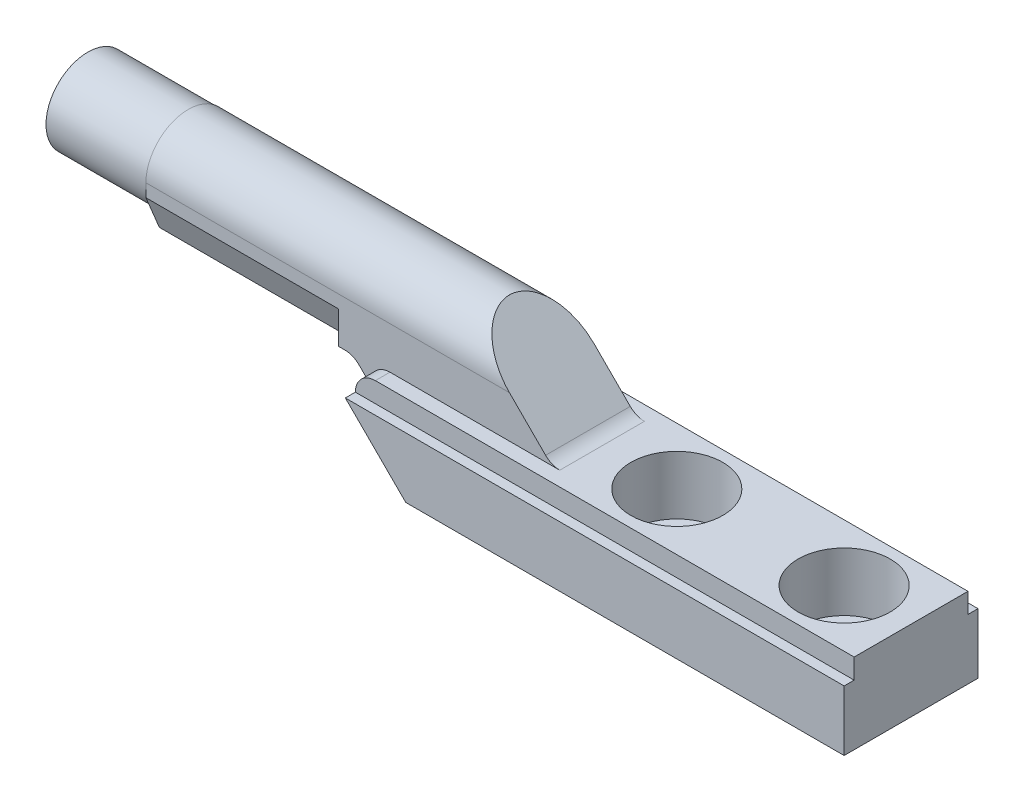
ISO-10303-21;
HEADER;
FILE_DESCRIPTION(('STEP AP214'),'2;1');
FILE_NAME('part.step','',(''),(''),'','','');
FILE_SCHEMA(('AUTOMOTIVE_DESIGN { 1 0 10303 214 1 1 1 1 }'));
ENDSEC;
DATA;
#1=APPLICATION_CONTEXT('core data for automotive mechanical design processes');
#2=APPLICATION_PROTOCOL_DEFINITION('international standard','automotive_design',2000,#1);
#3=PRODUCT_CONTEXT('',#1,'mechanical');
#4=PRODUCT('Part','Part','',(#3));
#5=PRODUCT_RELATED_PRODUCT_CATEGORY('part','',(#4));
#6=PRODUCT_DEFINITION_FORMATION('','',#4);
#7=PRODUCT_DEFINITION_CONTEXT('part definition',#1,'design');
#8=PRODUCT_DEFINITION('design','',#6,#7);
#9=PRODUCT_DEFINITION_SHAPE('','',#8);
#10=(LENGTH_UNIT() NAMED_UNIT(*) SI_UNIT(.MILLI.,.METRE.));
#11=(NAMED_UNIT(*) PLANE_ANGLE_UNIT() SI_UNIT($,.RADIAN.));
#12=(NAMED_UNIT(*) SI_UNIT($,.STERADIAN.) SOLID_ANGLE_UNIT());
#13=UNCERTAINTY_MEASURE_WITH_UNIT(LENGTH_MEASURE(1.E-05),#10,'distance_accuracy_value','');
#14=(GEOMETRIC_REPRESENTATION_CONTEXT(3) GLOBAL_UNCERTAINTY_ASSIGNED_CONTEXT((#13)) GLOBAL_UNIT_ASSIGNED_CONTEXT((#10,
#11,#12)) REPRESENTATION_CONTEXT('',''));
#15=CARTESIAN_POINT('',(0.,0.,0.));
#16=DIRECTION('',(0.,0.,1.));
#17=DIRECTION('',(1.,0.,0.));
#18=AXIS2_PLACEMENT_3D('',#15,#16,#17);
#19=CARTESIAN_POINT('',(-62.48,5.842,-7.33701777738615));
#20=DIRECTION('',(0.,-1.,0.));
#21=DIRECTION('',(0.,0.,-1.));
#22=AXIS2_PLACEMENT_3D('',#19,#20,#21);
#23=PLANE('',#22);
#24=DIRECTION('',(-1.,0.,0.));
#25=VECTOR('',#24,1.);
#26=CARTESIAN_POINT('',(-40.25,5.842,2.193));
#27=LINE('',#26,#25);
#28=CARTESIAN_POINT('',(-40.25,5.842,2.193));
#29=VERTEX_POINT('',#28);
#30=CARTESIAN_POINT('',(-54.86,5.842,2.193));
#31=VERTEX_POINT('',#30);
#32=EDGE_CURVE('E632',#29,#31,#27,.T.);
#33=ORIENTED_EDGE('',*,*,#32,.T.);
#34=DIRECTION('',(0.,0.,-1.));
#35=VECTOR('',#34,1.);
#36=CARTESIAN_POINT('',(-54.86,5.842,-7.33701777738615));
#37=LINE('',#36,#35);
#38=CARTESIAN_POINT('',(-54.86,5.842,-3.213));
#39=VERTEX_POINT('',#38);
#40=EDGE_CURVE('E647',#31,#39,#37,.T.);
#41=ORIENTED_EDGE('',*,*,#40,.T.);
#42=DIRECTION('',(1.,0.,0.));
#43=VECTOR('',#42,1.);
#44=CARTESIAN_POINT('',(-62.48,5.842,-3.213));
#45=LINE('',#44,#43);
#46=CARTESIAN_POINT('',(-39.7540002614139,5.842,-3.213));
#47=VERTEX_POINT('',#46);
#48=EDGE_CURVE('E556',#39,#47,#45,.T.);
#49=ORIENTED_EDGE('',*,*,#48,.T.);
#50=DIRECTION('',(0.,0.,-1.));
#51=VECTOR('',#50,1.);
#52=CARTESIAN_POINT('',(-39.7540002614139,5.842,-7.33701777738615));
#53=LINE('',#52,#51);
#54=CARTESIAN_POINT('',(-39.7540002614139,5.842,3.213));
#55=VERTEX_POINT('',#54);
#56=EDGE_CURVE('E671',#47,#55,#53,.F.);
#57=ORIENTED_EDGE('',*,*,#56,.T.);
#58=DIRECTION('',(1.,0.,0.));
#59=VECTOR('',#58,1.);
#60=CARTESIAN_POINT('',(-62.48,5.842,3.213));
#61=LINE('',#60,#59);
#62=CARTESIAN_POINT('',(-40.25,5.842,3.213));
#63=VERTEX_POINT('',#62);
#64=EDGE_CURVE('E559',#63,#55,#61,.T.);
#65=ORIENTED_EDGE('',*,*,#64,.F.);
#66=DIRECTION('',(0.,0.,1.));
#67=VECTOR('',#66,1.);
#68=CARTESIAN_POINT('',(-40.25,5.842,3.213));
#69=LINE('',#68,#67);
#70=EDGE_CURVE('E622',#29,#63,#69,.T.);
#71=ORIENTED_EDGE('',*,*,#70,.F.);
#72=EDGE_LOOP('',(#33,#41,#49,#57,#65,#71));
#73=FACE_BOUND('',#72,.T.);
#74=ADVANCED_FACE('F66',(#73),#23,.T.);
#75=CARTESIAN_POINT('',(-62.48,9.2839,0.));
#76=DIRECTION('',(1.,0.,0.));
#77=DIRECTION('',(0.,0.,-1.));
#78=AXIS2_PLACEMENT_3D('',#75,#76,#77);
#79=CYLINDRICAL_SURFACE('',#78,3.213);
#80=DIRECTION('',(1.,0.,0.));
#81=VECTOR('',#80,1.);
#82=CARTESIAN_POINT('',(-62.48,9.2839,-3.213));
#83=LINE('',#82,#81);
#84=CARTESIAN_POINT('',(-54.86,9.2839,-3.213));
#85=VERTEX_POINT('',#84);
#86=CARTESIAN_POINT('',(-27.2679,9.2839,-3.213));
#87=VERTEX_POINT('',#86);
#88=EDGE_CURVE('E553',#85,#87,#83,.T.);
#89=ORIENTED_EDGE('',*,*,#88,.F.);
#90=CARTESIAN_POINT('',(-54.86,9.2839,0.));
#91=DIRECTION('',(-1.,0.,0.));
#92=DIRECTION('',(0.,0.,1.));
#93=AXIS2_PLACEMENT_3D('',#90,#91,#92);
#94=CIRCLE('',#93,3.213);
#95=CARTESIAN_POINT('',(-54.86,9.2839,3.213));
#96=VERTEX_POINT('',#95);
#97=EDGE_CURVE('E642',#85,#96,#94,.F.);
#98=ORIENTED_EDGE('',*,*,#97,.T.);
#99=DIRECTION('',(1.,0.,0.));
#100=VECTOR('',#99,1.);
#101=CARTESIAN_POINT('',(-62.48,9.2839,3.213));
#102=LINE('',#101,#100);
#103=CARTESIAN_POINT('',(-27.2679,9.2839,3.213));
#104=VERTEX_POINT('',#103);
#105=EDGE_CURVE('E552',#96,#104,#102,.T.);
#106=ORIENTED_EDGE('',*,*,#105,.T.);
#107=CARTESIAN_POINT('',(-27.2679,9.2839,0.));
#108=DIRECTION('',(0.707106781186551,0.707106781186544,0.));
#109=DIRECTION('',(0.707106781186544,-0.707106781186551,0.));
#110=AXIS2_PLACEMENT_3D('',#107,#108,#109);
#111=ELLIPSE('',#110,4.54386817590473,3.213);
#112=CARTESIAN_POINT('',(-30.48,12.4960000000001,0.0760433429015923));
#113=VERTEX_POINT('',#112);
#114=EDGE_CURVE('E828',#104,#113,#111,.F.);
#115=ORIENTED_EDGE('',*,*,#114,.T.);
#116=CARTESIAN_POINT('',(-30.48,9.2839,0.));
#117=DIRECTION('',(1.,0.,0.));
#118=DIRECTION('',(0.,0.,-1.));
#119=AXIS2_PLACEMENT_3D('',#116,#117,#118);
#120=CIRCLE('',#119,3.213);
#121=CARTESIAN_POINT('',(-30.48,12.4960000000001,-0.0760433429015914));
#122=VERTEX_POINT('',#121);
#123=EDGE_CURVE('E548',#122,#113,#120,.T.);
#124=ORIENTED_EDGE('',*,*,#123,.F.);
#125=CARTESIAN_POINT('',(-27.2679,9.2839,0.));
#126=DIRECTION('',(0.707106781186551,0.707106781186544,0.));
#127=DIRECTION('',(0.707106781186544,-0.707106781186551,0.));
#128=AXIS2_PLACEMENT_3D('',#125,#126,#127);
#129=ELLIPSE('',#128,4.54386817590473,3.213);
#130=EDGE_CURVE('E803',#122,#87,#129,.F.);
#131=ORIENTED_EDGE('',*,*,#130,.T.);
#132=EDGE_LOOP('',(#89,#98,#106,#115,#124,#131));
#133=FACE_BOUND('',#132,.T.);
#134=ADVANCED_FACE('F290',(#133),#79,.T.);
#135=CARTESIAN_POINT('',(-62.48,9.16945,-3.213));
#136=DIRECTION('',(0.,0.,-1.));
#137=DIRECTION('',(0.,1.,0.));
#138=AXIS2_PLACEMENT_3D('',#135,#136,#137);
#139=PLANE('',#138);
#140=ORIENTED_EDGE('',*,*,#48,.F.);
#141=DIRECTION('',(0.,1.,0.));
#142=VECTOR('',#141,1.);
#143=CARTESIAN_POINT('',(-54.86,9.16945,-3.213));
#144=LINE('',#143,#142);
#145=EDGE_CURVE('E648',#39,#85,#144,.T.);
#146=ORIENTED_EDGE('',*,*,#145,.T.);
#147=ORIENTED_EDGE('',*,*,#88,.T.);
#148=DIRECTION('',(-0.707106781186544,0.707106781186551,0.));
#149=VECTOR('',#148,1.);
#150=CARTESIAN_POINT('',(-30.48,12.4960000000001,-3.213));
#151=LINE('',#150,#149);
#152=CARTESIAN_POINT('',(-24.5251976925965,6.54119769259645,-3.213));
#153=VERTEX_POINT('',#152);
#154=EDGE_CURVE('E806',#87,#153,#151,.F.);
#155=ORIENTED_EDGE('',*,*,#154,.T.);
#156=CARTESIAN_POINT('',(-23.4503953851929,7.616,-3.213));
#157=DIRECTION('',(0.,0.,-1.));
#158=DIRECTION('',(0.,1.,0.));
#159=AXIS2_PLACEMENT_3D('',#156,#157,#158);
#160=CIRCLE('',#159,1.52);
#161=CARTESIAN_POINT('',(-23.4503953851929,6.096,-3.213));
#162=VERTEX_POINT('',#161);
#163=EDGE_CURVE('E684',#153,#162,#160,.F.);
#164=ORIENTED_EDGE('',*,*,#163,.T.);
#165=DIRECTION('',(-1.,0.,0.));
#166=VECTOR('',#165,1.);
#167=CARTESIAN_POINT('',(0.,6.096,-3.213));
#168=LINE('',#167,#166);
#169=CARTESIAN_POINT('',(-36.3365091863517,6.096,-3.213));
#170=VERTEX_POINT('',#169);
#171=EDGE_CURVE('E339',#162,#170,#168,.T.);
#172=ORIENTED_EDGE('',*,*,#171,.T.);
#173=CARTESIAN_POINT('',(-36.3365091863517,4.576,-3.213));
#174=DIRECTION('',(0.,0.,-1.));
#175=DIRECTION('',(0.,1.,0.));
#176=AXIS2_PLACEMENT_3D('',#173,#174,#175);
#177=CIRCLE('',#176,1.52);
#178=CARTESIAN_POINT('',(-37.8565091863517,4.576,-3.213));
#179=VERTEX_POINT('',#178);
#180=EDGE_CURVE('E377',#170,#179,#177,.F.);
#181=ORIENTED_EDGE('',*,*,#180,.T.);
#182=DIRECTION('',(-0.707917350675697,0.706295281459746,0.));
#183=VECTOR('',#182,1.);
#184=CARTESIAN_POINT('',(-35.5679652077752,2.29269982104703,-3.213));
#185=LINE('',#184,#183);
#186=CARTESIAN_POINT('',(-38.680431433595,5.39803437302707,-3.213));
#187=VERTEX_POINT('',#186);
#188=EDGE_CURVE('E395',#179,#187,#185,.T.);
#189=ORIENTED_EDGE('',*,*,#188,.T.);
#190=CARTESIAN_POINT('',(-39.7540002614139,4.322,-3.213));
#191=DIRECTION('',(0.,0.,-1.));
#192=DIRECTION('',(0.,1.,0.));
#193=AXIS2_PLACEMENT_3D('',#190,#191,#192);
#194=CIRCLE('',#193,1.52);
#195=EDGE_CURVE('E674',#187,#47,#194,.F.);
#196=ORIENTED_EDGE('',*,*,#195,.T.);
#197=EDGE_LOOP('',(#140,#146,#147,#155,#164,#172,#181,#189,#196));
#198=FACE_BOUND('',#197,.T.);
#199=ADVANCED_FACE('F783',(#198),#139,.T.);
#200=CARTESIAN_POINT('',(-62.48,9.16945,3.213));
#201=DIRECTION('',(0.,0.,-1.));
#202=DIRECTION('',(-1.,0.,0.));
#203=AXIS2_PLACEMENT_3D('',#200,#201,#202);
#204=PLANE('',#203);
#205=DIRECTION('',(0.,1.,0.));
#206=VECTOR('',#205,1.);
#207=CARTESIAN_POINT('',(-54.86,9.16945,3.213));
#208=LINE('',#207,#206);
#209=CARTESIAN_POINT('',(-54.86,8.302,3.213));
#210=VERTEX_POINT('',#209);
#211=EDGE_CURVE('E673',#210,#96,#208,.T.);
#212=ORIENTED_EDGE('',*,*,#211,.F.);
#213=DIRECTION('',(-1.,0.,0.));
#214=VECTOR('',#213,1.);
#215=CARTESIAN_POINT('',(-40.25,8.302,3.213));
#216=LINE('',#215,#214);
#217=CARTESIAN_POINT('',(-40.25,8.302,3.213));
#218=VERTEX_POINT('',#217);
#219=EDGE_CURVE('E95',#218,#210,#216,.T.);
#220=ORIENTED_EDGE('',*,*,#219,.F.);
#221=DIRECTION('',(0.,1.,0.));
#222=VECTOR('',#221,1.);
#223=CARTESIAN_POINT('',(-40.25,5.842,3.213));
#224=LINE('',#223,#222);
#225=EDGE_CURVE('E625',#63,#218,#224,.T.);
#226=ORIENTED_EDGE('',*,*,#225,.F.);
#227=ORIENTED_EDGE('',*,*,#64,.T.);
#228=CARTESIAN_POINT('',(-39.7540002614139,4.322,3.213));
#229=DIRECTION('',(0.,0.,-1.));
#230=DIRECTION('',(-1.,0.,0.));
#231=AXIS2_PLACEMENT_3D('',#228,#229,#230);
#232=CIRCLE('',#231,1.52);
#233=CARTESIAN_POINT('',(-38.680431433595,5.39803437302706,3.213));
#234=VERTEX_POINT('',#233);
#235=EDGE_CURVE('E672',#55,#234,#232,.T.);
#236=ORIENTED_EDGE('',*,*,#235,.T.);
#237=DIRECTION('',(0.707917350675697,-0.706295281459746,0.));
#238=VECTOR('',#237,1.);
#239=CARTESIAN_POINT('',(-36.3314580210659,3.05444322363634,3.213));
#240=LINE('',#239,#238);
#241=CARTESIAN_POINT('',(-37.8565091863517,4.576,3.213));
#242=VERTEX_POINT('',#241);
#243=EDGE_CURVE('E391',#234,#242,#240,.T.);
#244=ORIENTED_EDGE('',*,*,#243,.T.);
#245=CARTESIAN_POINT('',(-36.3365091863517,4.576,3.213));
#246=DIRECTION('',(0.,0.,-1.));
#247=DIRECTION('',(-1.,0.,0.));
#248=AXIS2_PLACEMENT_3D('',#245,#246,#247);
#249=CIRCLE('',#248,1.52);
#250=CARTESIAN_POINT('',(-36.3365091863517,6.096,3.213));
#251=VERTEX_POINT('',#250);
#252=EDGE_CURVE('E380',#242,#251,#249,.T.);
#253=ORIENTED_EDGE('',*,*,#252,.T.);
#254=DIRECTION('',(-1.,0.,0.));
#255=VECTOR('',#254,1.);
#256=CARTESIAN_POINT('',(0.,6.096,3.213));
#257=LINE('',#256,#255);
#258=CARTESIAN_POINT('',(-23.4503953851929,6.096,3.213));
#259=VERTEX_POINT('',#258);
#260=EDGE_CURVE('E555',#259,#251,#257,.T.);
#261=ORIENTED_EDGE('',*,*,#260,.F.);
#262=CARTESIAN_POINT('',(-23.4503953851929,7.616,3.213));
#263=DIRECTION('',(0.,0.,-1.));
#264=DIRECTION('',(-1.,0.,0.));
#265=AXIS2_PLACEMENT_3D('',#262,#263,#264);
#266=CIRCLE('',#265,1.52);
#267=CARTESIAN_POINT('',(-24.5251976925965,6.54119769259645,3.213));
#268=VERTEX_POINT('',#267);
#269=EDGE_CURVE('E678',#259,#268,#266,.T.);
#270=ORIENTED_EDGE('',*,*,#269,.T.);
#271=DIRECTION('',(0.707106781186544,-0.707106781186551,0.));
#272=VECTOR('',#271,1.);
#273=CARTESIAN_POINT('',(-44.8167249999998,26.832725,3.213));
#274=LINE('',#273,#272);
#275=EDGE_CURVE('E811',#268,#104,#274,.F.);
#276=ORIENTED_EDGE('',*,*,#275,.T.);
#277=ORIENTED_EDGE('',*,*,#105,.F.);
#278=EDGE_LOOP('',(#212,#220,#226,#227,#236,#244,#253,#261,#270,#276,#277));
#279=FACE_BOUND('',#278,.T.);
#280=ADVANCED_FACE('F786',(#279),#204,.F.);
#281=CARTESIAN_POINT('',(0.,6.096,-5.08));
#282=DIRECTION('',(0.,1.,0.));
#283=DIRECTION('',(0.,0.,1.));
#284=AXIS2_PLACEMENT_3D('',#281,#282,#283);
#285=PLANE('',#284);
#286=CARTESIAN_POINT('',(-5.08,6.096,0.));
#287=DIRECTION('',(0.,1.,0.));
#288=DIRECTION('',(0.,0.,1.));
#289=AXIS2_PLACEMENT_3D('',#286,#287,#288);
#290=CIRCLE('',#289,3.4925);
#291=CARTESIAN_POINT('',(-5.08,6.096,3.4925));
#292=VERTEX_POINT('',#291);
#293=EDGE_CURVE('E583',#292,#292,#290,.T.);
#294=ORIENTED_EDGE('',*,*,#293,.F.);
#295=EDGE_LOOP('',(#294));
#296=FACE_BOUND('',#295,.T.);
#297=CARTESIAN_POINT('',(-17.78,6.096,0.));
#298=DIRECTION('',(0.,1.,0.));
#299=DIRECTION('',(0.,0.,1.));
#300=AXIS2_PLACEMENT_3D('',#297,#298,#299);
#301=CIRCLE('',#300,3.4925);
#302=CARTESIAN_POINT('',(-17.78,6.096,3.4925));
#303=VERTEX_POINT('',#302);
#304=EDGE_CURVE('E587',#303,#303,#301,.T.);
#305=ORIENTED_EDGE('',*,*,#304,.F.);
#306=EDGE_LOOP('',(#305));
#307=FACE_BOUND('',#306,.T.);
#308=DIRECTION('',(0.,0.,-1.));
#309=VECTOR('',#308,1.);
#310=CARTESIAN_POINT('',(-23.4503953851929,6.096,-5.08));
#311=LINE('',#310,#309);
#312=EDGE_CURVE('E383',#162,#259,#311,.F.);
#313=ORIENTED_EDGE('',*,*,#312,.T.);
#314=ORIENTED_EDGE('',*,*,#260,.T.);
#315=DIRECTION('',(0.,0.,-1.));
#316=VECTOR('',#315,1.);
#317=CARTESIAN_POINT('',(-36.3365091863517,6.096,4.32));
#318=LINE('',#317,#316);
#319=CARTESIAN_POINT('',(-36.3365091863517,6.096,4.32));
#320=VERTEX_POINT('',#319);
#321=EDGE_CURVE('E368',#251,#320,#318,.F.);
#322=ORIENTED_EDGE('',*,*,#321,.T.);
#323=DIRECTION('',(1.,0.,0.));
#324=VECTOR('',#323,1.);
#325=CARTESIAN_POINT('',(-62.481,6.096,4.32));
#326=LINE('',#325,#324);
#327=CARTESIAN_POINT('',(0.,6.096,4.32));
#328=VERTEX_POINT('',#327);
#329=EDGE_CURVE('E364',#320,#328,#326,.T.);
#330=ORIENTED_EDGE('',*,*,#329,.T.);
#331=DIRECTION('',(0.,0.,-1.));
#332=VECTOR('',#331,1.);
#333=CARTESIAN_POINT('',(0.,6.096,5.08));
#334=LINE('',#333,#332);
#335=CARTESIAN_POINT('',(0.,6.096,-4.32));
#336=VERTEX_POINT('',#335);
#337=EDGE_CURVE('E333',#328,#336,#334,.T.);
#338=ORIENTED_EDGE('',*,*,#337,.T.);
#339=DIRECTION('',(1.,0.,0.));
#340=VECTOR('',#339,1.);
#341=CARTESIAN_POINT('',(-62.481,6.096,-4.32));
#342=LINE('',#341,#340);
#343=CARTESIAN_POINT('',(-36.3365091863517,6.096,-4.32));
#344=VERTEX_POINT('',#343);
#345=EDGE_CURVE('E342',#344,#336,#342,.T.);
#346=ORIENTED_EDGE('',*,*,#345,.F.);
#347=DIRECTION('',(0.,0.,-1.));
#348=VECTOR('',#347,1.);
#349=CARTESIAN_POINT('',(-36.3365091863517,6.096,-3.213));
#350=LINE('',#349,#348);
#351=EDGE_CURVE('E371',#344,#170,#350,.F.);
#352=ORIENTED_EDGE('',*,*,#351,.T.);
#353=ORIENTED_EDGE('',*,*,#171,.F.);
#354=EDGE_LOOP('',(#313,#314,#322,#330,#338,#346,#352,#353));
#355=FACE_BOUND('',#354,.T.);
#356=ADVANCED_FACE('F288',(#296,#307,#355),#285,.T.);
#357=CARTESIAN_POINT('',(-33.27,0.,5.08));
#358=DIRECTION('',(0.,1.,0.));
#359=DIRECTION('',(0.,0.,1.));
#360=AXIS2_PLACEMENT_3D('',#357,#358,#359);
#361=PLANE('',#360);
#362=CARTESIAN_POINT('',(-24.8687563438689,-1.14918915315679,0.));
#363=DIRECTION('',(-0.706932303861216,0.707281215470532,0.));
#364=DIRECTION('',(-0.707281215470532,-0.706932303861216,0.));
#365=AXIS2_PLACEMENT_3D('',#362,#363,#364);
#366=CIRCLE('',#365,1.6256);
#367=CARTESIAN_POINT('',(-23.7190044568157,-4.68714375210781E-06,0.00983865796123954));
#368=VERTEX_POINT('',#367);
#369=CARTESIAN_POINT('',(-23.7189871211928,1.28724539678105E-05,0.00053929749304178));
#370=VERTEX_POINT('',#369);
#371=EDGE_CURVE('E70',#368,#370,#366,.T.);
#372=ORIENTED_EDGE('',*,*,#371,.T.);
#373=CARTESIAN_POINT('',(-23.7190088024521,-9.01722288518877E-06,-0.0119997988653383));
#374=VERTEX_POINT('',#373);
#375=EDGE_CURVE('E252',#370,#374,#366,.T.);
#376=ORIENTED_EDGE('',*,*,#375,.T.);
#377=CARTESIAN_POINT('',(-23.7189990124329,4.9353994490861E-07,-0.0118840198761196));
#378=CARTESIAN_POINT('',(-23.7193088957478,1.81451106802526E-07,-0.0472368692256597));
#379=CARTESIAN_POINT('',(-23.7212788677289,4.95929308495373E-08,-0.0825491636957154));
#380=CARTESIAN_POINT('',(-23.7284430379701,-4.95427912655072E-08,-0.152810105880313));
#381=CARTESIAN_POINT('',(-23.7336339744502,-1.69865974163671E-08,-0.18775908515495));
#382=CARTESIAN_POINT('',(-23.753780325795,3.36705161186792E-08,-0.291127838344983));
#383=CARTESIAN_POINT('',(-23.7733186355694,6.16742159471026E-09,-0.358707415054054));
#384=CARTESIAN_POINT('',(-23.8104312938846,-3.07759324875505E-09,-0.456862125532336));
#385=CARTESIAN_POINT('',(-23.8240855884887,-8.42416257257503E-10,-0.489014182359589));
#386=CARTESIAN_POINT('',(-23.8538643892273,8.42296235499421E-10,-0.552155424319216));
#387=CARTESIAN_POINT('',(-23.8699885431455,2.92228570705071E-10,-0.583144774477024));
#388=CARTESIAN_POINT('',(-23.9217877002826,-5.85371338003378E-10,-0.674315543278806));
#389=CARTESIAN_POINT('',(-23.9608495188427,-1.36157320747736E-10,-0.732596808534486));
#390=CARTESIAN_POINT('',(-24.0354540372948,1.02544317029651E-10,-0.829951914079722));
#391=CARTESIAN_POINT('',(-24.0694863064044,2.74819115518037E-11,-0.870216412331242));
#392=CARTESIAN_POINT('',(-24.1409705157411,-2.74916908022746E-11,-0.947616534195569));
#393=CARTESIAN_POINT('',(-24.1784236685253,-7.36901926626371E-12,-0.984751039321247));
#394=CARTESIAN_POINT('',(-24.256246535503,7.38284518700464E-12,-1.05595764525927));
#395=CARTESIAN_POINT('',(-24.2966215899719,1.96413582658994E-12,-1.09002386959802));
#396=CARTESIAN_POINT('',(-24.3797737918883,-1.96411471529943E-12,-1.15507623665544));
#397=CARTESIAN_POINT('',(-24.4225509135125,-4.73730158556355E-13,-1.18606241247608));
#398=CARTESIAN_POINT('',(-24.49710032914,2.82660957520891E-13,-1.23631786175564));
#399=CARTESIAN_POINT('',(-24.5283722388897,0.,-1.25633588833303));
#400=CARTESIAN_POINT('',(-24.5918179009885,0.,-1.29489024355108));
#401=CARTESIAN_POINT('',(-24.6239917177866,0.,-1.31342646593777));
#402=CARTESIAN_POINT('',(-24.7216957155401,0.,-1.36692403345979));
#403=CARTESIAN_POINT('',(-24.7883963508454,0.,-1.39976622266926));
#404=CARTESIAN_POINT('',(-24.9241826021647,0.,-1.46008172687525));
#405=CARTESIAN_POINT('',(-24.9932689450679,0.,-1.48755338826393));
#406=CARTESIAN_POINT('',(-25.1332950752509,0.,-1.53721116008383));
#407=CARTESIAN_POINT('',(-25.2042344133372,0.,-1.5593985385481));
#408=CARTESIAN_POINT('',(-25.3494051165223,0.,-1.59896920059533));
#409=CARTESIAN_POINT('',(-25.4236742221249,0.,-1.61621419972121));
#410=CARTESIAN_POINT('',(-25.5733139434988,0.,-1.64500240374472));
#411=CARTESIAN_POINT('',(-25.648684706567,0.,-1.65654483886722));
#412=CARTESIAN_POINT('',(-25.8001259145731,0.,-1.67423472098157));
#413=CARTESIAN_POINT('',(-25.8761969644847,0.,-1.68037695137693));
#414=CARTESIAN_POINT('',(-26.028586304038,0.,-1.68717494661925));
#415=CARTESIAN_POINT('',(-26.1049046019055,0.,-1.68783052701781));
#416=CARTESIAN_POINT('',(-26.2688690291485,0.,-1.68308383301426));
#417=CARTESIAN_POINT('',(-26.3564924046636,0.,-1.67675555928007));
#418=CARTESIAN_POINT('',(-26.5307533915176,0.,-1.65566706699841));
#419=CARTESIAN_POINT('',(-26.6173908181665,0.,-1.64090529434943));
#420=CARTESIAN_POINT('',(-26.7885686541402,0.,-1.60291409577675));
#421=CARTESIAN_POINT('',(-26.8731136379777,0.,-1.57970528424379));
#422=CARTESIAN_POINT('',(-27.0393472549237,0.,-1.52467183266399));
#423=CARTESIAN_POINT('',(-27.1210373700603,0.,-1.4928517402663));
#424=CARTESIAN_POINT('',(-27.249095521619,0.,-1.43434742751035));
#425=CARTESIAN_POINT('',(-27.2967801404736,0.,-1.41052355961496));
#426=CARTESIAN_POINT('',(-27.390161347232,0.,-1.35926845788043));
#427=CARTESIAN_POINT('',(-27.4358586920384,0.,-1.33183861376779));
#428=CARTESIAN_POINT('',(-27.5247994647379,0.,-1.27334430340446));
#429=CARTESIAN_POINT('',(-27.5680456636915,0.,-1.24228406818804));
#430=CARTESIAN_POINT('',(-27.6517476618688,0.,-1.1766241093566));
#431=CARTESIAN_POINT('',(-27.6922032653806,0.,-1.14202413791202));
#432=CARTESIAN_POINT('',(-27.7971381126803,0.,-1.04385841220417));
#433=CARTESIAN_POINT('',(-27.8586134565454,0.,-0.976968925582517));
#434=CARTESIAN_POINT('',(-27.9419255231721,0.,-0.869827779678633));
#435=CARTESIAN_POINT('',(-27.9682200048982,0.,-0.832966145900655));
#436=CARTESIAN_POINT('',(-28.0174532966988,0.,-0.757044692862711));
#437=CARTESIAN_POINT('',(-28.0403919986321,0.,-0.71798480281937));
#438=CARTESIAN_POINT('',(-28.0828151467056,0.,-0.637720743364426));
#439=CARTESIAN_POINT('',(-28.1022771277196,0.,-0.596504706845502));
#440=CARTESIAN_POINT('',(-28.1372719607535,0.,-0.512437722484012));
#441=CARTESIAN_POINT('',(-28.1528053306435,0.,-0.469586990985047));
#442=CARTESIAN_POINT('',(-28.1797196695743,0.,-0.382612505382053));
#443=CARTESIAN_POINT('',(-28.1911018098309,0.,-0.338489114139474));
#444=CARTESIAN_POINT('',(-28.2095566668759,0.,-0.249348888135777));
#445=CARTESIAN_POINT('',(-28.216629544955,2.98931724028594E-13,-0.204332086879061));
#446=CARTESIAN_POINT('',(-28.225864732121,2.70780339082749E-13,-0.118713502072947));
#447=CARTESIAN_POINT('',(-28.2284744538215,0.,-0.0781592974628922));
#448=CARTESIAN_POINT('',(-28.2301766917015,0.,0.00301674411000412));
#449=CARTESIAN_POINT('',(-28.2292699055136,0.,0.0436385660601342));
#450=CARTESIAN_POINT('',(-28.2238871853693,0.,0.124636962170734));
#451=CARTESIAN_POINT('',(-28.2194122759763,0.,0.165013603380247));
#452=CARTESIAN_POINT('',(-28.2069709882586,0.,0.245216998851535));
#453=CARTESIAN_POINT('',(-28.1990040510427,0.,0.28504366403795));
#454=CARTESIAN_POINT('',(-28.1707222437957,1.34232819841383E-13,0.401069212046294));
#455=CARTESIAN_POINT('',(-28.1458437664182,0.,0.476210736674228));
#456=CARTESIAN_POINT('',(-28.084376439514,0.,0.621482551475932));
#457=CARTESIAN_POINT('',(-28.0477854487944,0.,0.691611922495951));
#458=CARTESIAN_POINT('',(-27.9620677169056,0.,0.829736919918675));
#459=CARTESIAN_POINT('',(-27.9123106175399,0.,0.897339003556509));
#460=CARTESIAN_POINT('',(-27.8033565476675,0.,1.02452183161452));
#461=CARTESIAN_POINT('',(-27.7441511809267,0.,1.08409535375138));
#462=CARTESIAN_POINT('',(-27.645408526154,0.,1.17072494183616));
#463=CARTESIAN_POINT('',(-27.6083969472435,0.,1.20072682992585));
#464=CARTESIAN_POINT('',(-27.5323087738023,0.,1.25791248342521));
#465=CARTESIAN_POINT('',(-27.4932343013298,0.,1.28509906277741));
#466=CARTESIAN_POINT('',(-27.4132144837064,0.,1.33665650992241));
#467=CARTESIAN_POINT('',(-27.3722671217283,0.,1.36102423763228));
#468=CARTESIAN_POINT('',(-27.2888212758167,0.,1.40697102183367));
#469=CARTESIAN_POINT('',(-27.2463221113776,0.,1.42854883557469));
#470=CARTESIAN_POINT('',(-27.1396794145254,0.,1.4785627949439));
#471=CARTESIAN_POINT('',(-27.0747930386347,0.,1.50542510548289));
#472=CARTESIAN_POINT('',(-26.9429488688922,0.,1.55345810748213));
#473=CARTESIAN_POINT('',(-26.8759905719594,0.,1.5746274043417));
#474=CARTESIAN_POINT('',(-26.7404960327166,0.,1.61145296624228));
#475=CARTESIAN_POINT('',(-26.671958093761,0.,1.6271029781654));
#476=CARTESIAN_POINT('',(-26.5338627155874,0.,1.65285791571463));
#477=CARTESIAN_POINT('',(-26.4643053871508,0.,1.66296343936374));
#478=CARTESIAN_POINT('',(-26.3239705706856,0.,1.67805077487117));
#479=CARTESIAN_POINT('',(-26.2531877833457,0.,1.68298229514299));
#480=CARTESIAN_POINT('',(-26.1114450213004,0.,1.68789999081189));
#481=CARTESIAN_POINT('',(-26.0404850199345,0.,1.6878853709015));
#482=CARTESIAN_POINT('',(-25.8986744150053,0.,1.68302049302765));
#483=CARTESIAN_POINT('',(-25.8278239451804,0.,1.67816634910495));
#484=CARTESIAN_POINT('',(-25.6866322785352,0.,1.66362089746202));
#485=CARTESIAN_POINT('',(-25.6162909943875,0.,1.65393044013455));
#486=CARTESIAN_POINT('',(-25.4619646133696,0.,1.62695650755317));
#487=CARTESIAN_POINT('',(-25.3781787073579,0.,1.60851433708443));
#488=CARTESIAN_POINT('',(-25.2124634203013,0.,1.56448811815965));
#489=CARTESIAN_POINT('',(-25.130535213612,0.,1.53889968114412));
#490=CARTESIAN_POINT('',(-24.9692629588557,0.,1.48078734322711));
#491=CARTESIAN_POINT('',(-24.8899158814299,0.,1.44827193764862));
#492=CARTESIAN_POINT('',(-24.7734429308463,0.,1.39413070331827));
#493=CARTESIAN_POINT('',(-24.7350519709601,0.,1.37519403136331));
#494=CARTESIAN_POINT('',(-24.6592452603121,0.,1.33546506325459));
#495=CARTESIAN_POINT('',(-24.6218293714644,0.,1.31467303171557));
#496=CARTESIAN_POINT('',(-24.5391611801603,0.,1.26577111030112));
#497=CARTESIAN_POINT('',(-24.4942287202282,0.,1.23711471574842));
#498=CARTESIAN_POINT('',(-24.4065197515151,0.,1.17670384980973));
#499=CARTESIAN_POINT('',(-24.3637431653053,0.,1.14494948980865));
#500=CARTESIAN_POINT('',(-24.2392591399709,0.,1.04508301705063));
#501=CARTESIAN_POINT('',(-24.1611908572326,0.,0.972247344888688));
#502=CARTESIAN_POINT('',(-24.0351841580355,0.,0.832110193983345));
#503=CARTESIAN_POINT('',(-23.9844355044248,0.,0.7673386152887));
#504=CARTESIAN_POINT('',(-23.8940765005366,0.,0.630360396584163));
#505=CARTESIAN_POINT('',(-23.8544544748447,0.,0.5581616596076));
#506=CARTESIAN_POINT('',(-23.7944977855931,0.,0.420084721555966));
#507=CARTESIAN_POINT('',(-23.7720630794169,0.,0.355118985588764));
#508=CARTESIAN_POINT('',(-23.7385098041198,0.,0.222378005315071));
#509=CARTESIAN_POINT('',(-23.7273635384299,0.,0.154610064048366));
#510=CARTESIAN_POINT('',(-23.7212786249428,0.,0.0737226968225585));
#511=CARTESIAN_POINT('',(-23.7205292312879,0.,0.0609290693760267));
#512=CARTESIAN_POINT('',(-23.7194504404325,0.,0.0353346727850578));
#513=CARTESIAN_POINT('',(-23.7191206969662,0.,0.0225339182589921));
#514=CARTESIAN_POINT('',(-23.7189980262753,0.,0.00972735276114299));
#515=B_SPLINE_CURVE_WITH_KNOTS('',3,(#377,#378,#379,#380,#381,#382,#383,#384,#385,#386,#387,
#388,#389,#390,#391,#392,#393,#394,#395,#396,#397,#398,#399,#400,#401,#402,#403,#404,#405,#406,
#407,#408,#409,#410,#411,#412,#413,#414,#415,#416,#417,#418,#419,#420,#421,#422,#423,#424,#425,
#426,#427,#428,#429,#430,#431,#432,#433,#434,#435,#436,#437,#438,#439,#440,#441,#442,#443,#444,
#445,#446,#447,#448,#449,#450,#451,#452,#453,#454,#455,#456,#457,#458,#459,#460,#461,#462,#463,
#464,#465,#466,#467,#468,#469,#470,#471,#472,#473,#474,#475,#476,#477,#478,#479,#480,#481,#482,
#483,#484,#485,#486,#487,#488,#489,#490,#491,#492,#493,#494,#495,#496,#497,#498,#499,#500,#501,
#502,#503,#504,#505,#506,#507,#508,#509,#510,#511,#512,#513,#514),.UNSPECIFIED.,.F.,.F.,(4,2,2,
2,2,2,2,2,2,2,2,2,2,2,2,2,2,2,2,2,2,2,2,2,2,2,2,2,2,2,2,2,2,2,2,2,2,2,2,2,2,2,2,2,2,2,2,2,2,2,2,
2,2,2,2,2,2,2,2,2,2,2,2,2,2,2,2,2,4),(0.,0.105975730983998,0.21184431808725,0.421695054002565,
0.52641220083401,0.631114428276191,0.840846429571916,0.998820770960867,1.15685132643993,
1.31517838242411,1.47350373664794,1.58485606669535,1.6962163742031,1.91898042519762,
2.14181295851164,2.36459196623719,2.59310256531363,2.82164400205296,3.05040596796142,
3.27917562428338,3.54235474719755,3.80558238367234,4.06817189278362,4.33062299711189,
4.4904053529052,4.65012630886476,4.8096629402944,4.96921074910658,5.24042833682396,
5.37612768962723,5.51183141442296,5.64838256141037,5.78491569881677,5.92141028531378,
6.05789976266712,6.17966575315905,6.30140758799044,6.42311447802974,6.54484085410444,
6.78116807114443,7.01753851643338,7.26838127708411,7.51944820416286,7.66226845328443,
7.80494454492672,7.94777807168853,8.09067500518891,8.30105921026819,8.51149490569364,
8.72216825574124,8.93281887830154,9.1454985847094,9.35821248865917,9.571097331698,
9.78394475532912,10.0409805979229,10.2981746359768,10.5550550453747,10.6834347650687,
10.8117962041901,10.9715311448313,11.1312603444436,11.4500081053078,11.6960191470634,
11.9417710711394,12.1471182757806,12.3519604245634,12.3904042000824,12.4288162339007),.UNSPECIFIED.);
#516=EDGE_CURVE('E13',#374,#368,#515,.T.);
#517=ORIENTED_EDGE('',*,*,#516,.T.);
#518=EDGE_LOOP('',(#372,#376,#517));
#519=FACE_BOUND('',#518,.T.);
#520=CARTESIAN_POINT('',(-5.08,0.,0.));
#521=DIRECTION('',(0.,1.,0.));
#522=DIRECTION('',(0.,0.,1.));
#523=AXIS2_PLACEMENT_3D('',#520,#521,#522);
#524=CIRCLE('',#523,2.1845);
#525=CARTESIAN_POINT('',(-5.08,0.,2.1845));
#526=VERTEX_POINT('',#525);
#527=EDGE_CURVE('E591',#526,#526,#524,.F.);
#528=ORIENTED_EDGE('',*,*,#527,.F.);
#529=EDGE_LOOP('',(#528));
#530=FACE_BOUND('',#529,.T.);
#531=CARTESIAN_POINT('',(-17.78,0.,0.));
#532=DIRECTION('',(0.,1.,0.));
#533=DIRECTION('',(0.,0.,1.));
#534=AXIS2_PLACEMENT_3D('',#531,#532,#533);
#535=CIRCLE('',#534,2.1845);
#536=CARTESIAN_POINT('',(-17.78,0.,2.1845));
#537=VERTEX_POINT('',#536);
#538=EDGE_CURVE('E604',#537,#537,#535,.F.);
#539=ORIENTED_EDGE('',*,*,#538,.F.);
#540=EDGE_LOOP('',(#539));
#541=FACE_BOUND('',#540,.T.);
#542=DIRECTION('',(0.,0.,1.));
#543=VECTOR('',#542,1.);
#544=CARTESIAN_POINT('',(-33.27,0.,-5.08));
#545=LINE('',#544,#543);
#546=CARTESIAN_POINT('',(-33.27,0.,-5.08));
#547=VERTEX_POINT('',#546);
#548=CARTESIAN_POINT('',(-33.27,0.,5.08));
#549=VERTEX_POINT('',#548);
#550=EDGE_CURVE('E448',#547,#549,#545,.T.);
#551=ORIENTED_EDGE('',*,*,#550,.F.);
#552=DIRECTION('',(-1.,0.,0.));
#553=VECTOR('',#552,1.);
#554=CARTESIAN_POINT('',(-33.27,0.,-5.08));
#555=LINE('',#554,#553);
#556=CARTESIAN_POINT('',(0.,0.,-5.08));
#557=VERTEX_POINT('',#556);
#558=EDGE_CURVE('E573',#557,#547,#555,.T.);
#559=ORIENTED_EDGE('',*,*,#558,.F.);
#560=DIRECTION('',(0.,0.,-1.));
#561=VECTOR('',#560,1.);
#562=CARTESIAN_POINT('',(0.,0.,-5.08));
#563=LINE('',#562,#561);
#564=CARTESIAN_POINT('',(0.,0.,5.08));
#565=VERTEX_POINT('',#564);
#566=EDGE_CURVE('E444',#565,#557,#563,.T.);
#567=ORIENTED_EDGE('',*,*,#566,.F.);
#568=DIRECTION('',(1.,0.,0.));
#569=VECTOR('',#568,1.);
#570=CARTESIAN_POINT('',(-33.27,0.,5.08));
#571=LINE('',#570,#569);
#572=EDGE_CURVE('E455',#549,#565,#571,.T.);
#573=ORIENTED_EDGE('',*,*,#572,.F.);
#574=EDGE_LOOP('',(#551,#559,#567,#573));
#575=FACE_BOUND('',#574,.T.);
#576=ADVANCED_FACE('F263',(#519,#530,#541,#575),#361,.F.);
#577=CARTESIAN_POINT('',(0.,-33.193767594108,-5.08));
#578=DIRECTION('',(0.,0.,-1.));
#579=DIRECTION('',(-1.,0.,0.));
#580=AXIS2_PLACEMENT_3D('',#577,#578,#579);
#581=PLANE('',#580);
#582=DIRECTION('',(1.,0.,0.));
#583=VECTOR('',#582,1.);
#584=CARTESIAN_POINT('',(-62.481,4.576,-5.08));
#585=LINE('',#584,#583);
#586=CARTESIAN_POINT('',(-37.8565091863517,4.576,-5.08));
#587=VERTEX_POINT('',#586);
#588=CARTESIAN_POINT('',(0.,4.576,-5.08));
#589=VERTEX_POINT('',#588);
#590=EDGE_CURVE('E359',#587,#589,#585,.T.);
#591=ORIENTED_EDGE('',*,*,#590,.T.);
#592=DIRECTION('',(0.,1.,0.));
#593=VECTOR('',#592,1.);
#594=CARTESIAN_POINT('',(0.,0.,-5.08));
#595=LINE('',#594,#593);
#596=EDGE_CURVE('E442',#557,#589,#595,.T.);
#597=ORIENTED_EDGE('',*,*,#596,.F.);
#598=ORIENTED_EDGE('',*,*,#558,.T.);
#599=DIRECTION('',(-0.707917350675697,0.706295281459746,0.));
#600=VECTOR('',#599,1.);
#601=CARTESIAN_POINT('',(-33.27,0.,-5.08));
#602=LINE('',#601,#600);
#603=EDGE_CURVE('E449',#547,#587,#602,.T.);
#604=ORIENTED_EDGE('',*,*,#603,.T.);
#605=EDGE_LOOP('',(#591,#597,#598,#604));
#606=FACE_BOUND('',#605,.T.);
#607=ADVANCED_FACE('F287',(#606),#581,.T.);
#608=CARTESIAN_POINT('',(0.,6.096,-5.08));
#609=DIRECTION('',(-1.,0.,0.));
#610=DIRECTION('',(0.,0.,1.));
#611=AXIS2_PLACEMENT_3D('',#608,#609,#610);
#612=PLANE('',#611);
#613=ORIENTED_EDGE('',*,*,#596,.T.);
#614=DIRECTION('',(0.,0.,-1.));
#615=VECTOR('',#614,1.);
#616=CARTESIAN_POINT('',(0.,4.576,-5.08));
#617=LINE('',#616,#615);
#618=CARTESIAN_POINT('',(0.,4.576,-4.32));
#619=VERTEX_POINT('',#618);
#620=EDGE_CURVE('E347',#619,#589,#617,.T.);
#621=ORIENTED_EDGE('',*,*,#620,.F.);
#622=DIRECTION('',(0.,-1.,0.));
#623=VECTOR('',#622,1.);
#624=CARTESIAN_POINT('',(0.,6.096,-4.32));
#625=LINE('',#624,#623);
#626=EDGE_CURVE('E415',#336,#619,#625,.T.);
#627=ORIENTED_EDGE('',*,*,#626,.F.);
#628=ORIENTED_EDGE('',*,*,#337,.F.);
#629=DIRECTION('',(0.,1.,0.));
#630=VECTOR('',#629,1.);
#631=CARTESIAN_POINT('',(0.,6.096,4.32));
#632=LINE('',#631,#630);
#633=CARTESIAN_POINT('',(0.,4.576,4.32));
#634=VERTEX_POINT('',#633);
#635=EDGE_CURVE('E358',#634,#328,#632,.T.);
#636=ORIENTED_EDGE('',*,*,#635,.F.);
#637=DIRECTION('',(0.,0.,-1.));
#638=VECTOR('',#637,1.);
#639=CARTESIAN_POINT('',(0.,4.576,5.08));
#640=LINE('',#639,#638);
#641=CARTESIAN_POINT('',(0.,4.576,5.08));
#642=VERTEX_POINT('',#641);
#643=EDGE_CURVE('E354',#642,#634,#640,.T.);
#644=ORIENTED_EDGE('',*,*,#643,.F.);
#645=DIRECTION('',(0.,1.,0.));
#646=VECTOR('',#645,1.);
#647=CARTESIAN_POINT('',(0.,0.,5.08));
#648=LINE('',#647,#646);
#649=EDGE_CURVE('E338',#565,#642,#648,.T.);
#650=ORIENTED_EDGE('',*,*,#649,.F.);
#651=ORIENTED_EDGE('',*,*,#566,.T.);
#652=EDGE_LOOP('',(#613,#621,#627,#628,#636,#644,#650,#651));
#653=FACE_BOUND('',#652,.T.);
#654=ADVANCED_FACE('F440',(#653),#612,.F.);
#655=CARTESIAN_POINT('',(-39.38,6.096,5.08));
#656=DIRECTION('',(0.706295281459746,0.707917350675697,0.));
#657=DIRECTION('',(-0.707917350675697,0.706295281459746,0.));
#658=AXIS2_PLACEMENT_3D('',#655,#656,#657);
#659=PLANE('',#658);
#660=ORIENTED_EDGE('',*,*,#243,.F.);
#661=DIRECTION('',(0.,0.,-1.));
#662=VECTOR('',#661,1.);
#663=CARTESIAN_POINT('',(-38.680431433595,5.39803437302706,5.08));
#664=LINE('',#663,#662);
#665=EDGE_CURVE('E390',#234,#187,#664,.T.);
#666=ORIENTED_EDGE('',*,*,#665,.T.);
#667=ORIENTED_EDGE('',*,*,#188,.F.);
#668=DIRECTION('',(0.,0.,1.));
#669=VECTOR('',#668,1.);
#670=CARTESIAN_POINT('',(-37.8565091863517,4.576,-4.32));
#671=LINE('',#670,#669);
#672=CARTESIAN_POINT('',(-37.8565091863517,4.576,-4.32));
#673=VERTEX_POINT('',#672);
#674=EDGE_CURVE('E402',#673,#179,#671,.T.);
#675=ORIENTED_EDGE('',*,*,#674,.F.);
#676=DIRECTION('',(0.,0.,1.));
#677=VECTOR('',#676,1.);
#678=CARTESIAN_POINT('',(-37.8565091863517,4.576,-5.08));
#679=LINE('',#678,#677);
#680=EDGE_CURVE('E406',#587,#673,#679,.T.);
#681=ORIENTED_EDGE('',*,*,#680,.F.);
#682=ORIENTED_EDGE('',*,*,#603,.F.);
#683=ORIENTED_EDGE('',*,*,#550,.T.);
#684=DIRECTION('',(-0.707917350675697,0.706295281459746,0.));
#685=VECTOR('',#684,1.);
#686=CARTESIAN_POINT('',(-33.27,0.,5.08));
#687=LINE('',#686,#685);
#688=CARTESIAN_POINT('',(-37.8565091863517,4.57600000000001,5.08));
#689=VERTEX_POINT('',#688);
#690=EDGE_CURVE('E458',#549,#689,#687,.T.);
#691=ORIENTED_EDGE('',*,*,#690,.T.);
#692=DIRECTION('',(0.,0.,1.));
#693=VECTOR('',#692,1.);
#694=CARTESIAN_POINT('',(-37.8565091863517,4.576,5.08));
#695=LINE('',#694,#693);
#696=CARTESIAN_POINT('',(-37.8565091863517,4.576,4.32));
#697=VERTEX_POINT('',#696);
#698=EDGE_CURVE('E367',#697,#689,#695,.T.);
#699=ORIENTED_EDGE('',*,*,#698,.F.);
#700=DIRECTION('',(0.,0.,1.));
#701=VECTOR('',#700,1.);
#702=CARTESIAN_POINT('',(-37.8565091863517,4.576,4.32));
#703=LINE('',#702,#701);
#704=EDGE_CURVE('E396',#242,#697,#703,.T.);
#705=ORIENTED_EDGE('',*,*,#704,.F.);
#706=EDGE_LOOP('',(#660,#666,#667,#675,#681,#682,#683,#691,#699,#705));
#707=FACE_BOUND('',#706,.T.);
#708=ADVANCED_FACE('F478',(#707),#659,.F.);
#709=CARTESIAN_POINT('',(0.,6.096,5.08));
#710=DIRECTION('',(0.,0.,-1.));
#711=DIRECTION('',(-1.,0.,0.));
#712=AXIS2_PLACEMENT_3D('',#709,#710,#711);
#713=PLANE('',#712);
#714=ORIENTED_EDGE('',*,*,#649,.T.);
#715=DIRECTION('',(1.,0.,0.));
#716=VECTOR('',#715,1.);
#717=CARTESIAN_POINT('',(-62.481,4.576,5.08));
#718=LINE('',#717,#716);
#719=EDGE_CURVE('E535',#689,#642,#718,.T.);
#720=ORIENTED_EDGE('',*,*,#719,.F.);
#721=ORIENTED_EDGE('',*,*,#690,.F.);
#722=ORIENTED_EDGE('',*,*,#572,.T.);
#723=EDGE_LOOP('',(#714,#720,#721,#722));
#724=FACE_BOUND('',#723,.T.);
#725=ADVANCED_FACE('F289',(#724),#713,.F.);
#726=CARTESIAN_POINT('',(-30.48,9.16945,-7.33701777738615));
#727=DIRECTION('',(1.,0.,0.));
#728=DIRECTION('',(0.,0.,-1.));
#729=AXIS2_PLACEMENT_3D('',#726,#727,#728);
#730=PLANE('',#729);
#731=ORIENTED_EDGE('',*,*,#123,.T.);
#732=DIRECTION('',(0.,0.,-1.));
#733=VECTOR('',#732,1.);
#734=CARTESIAN_POINT('',(-30.48,12.4960000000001,-3.213));
#735=LINE('',#734,#733);
#736=EDGE_CURVE('E575',#113,#122,#735,.T.);
#737=ORIENTED_EDGE('',*,*,#736,.T.);
#738=EDGE_LOOP('',(#731,#737));
#739=FACE_BOUND('',#738,.T.);
#740=ADVANCED_FACE('F490',(#739),#730,.T.);
#741=CARTESIAN_POINT('',(-30.48,12.4960000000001,-7.33701777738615));
#742=DIRECTION('',(0.707106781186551,0.707106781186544,0.));
#743=DIRECTION('',(-0.707106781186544,0.707106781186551,0.));
#744=AXIS2_PLACEMENT_3D('',#741,#742,#743);
#745=PLANE('',#744);
#746=ORIENTED_EDGE('',*,*,#275,.F.);
#747=DIRECTION('',(0.,0.,1.));
#748=VECTOR('',#747,1.);
#749=CARTESIAN_POINT('',(-24.5251976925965,6.54119769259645,-7.33701777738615));
#750=LINE('',#749,#748);
#751=EDGE_CURVE('E387',#268,#153,#750,.F.);
#752=ORIENTED_EDGE('',*,*,#751,.T.);
#753=ORIENTED_EDGE('',*,*,#154,.F.);
#754=ORIENTED_EDGE('',*,*,#130,.F.);
#755=ORIENTED_EDGE('',*,*,#736,.F.);
#756=ORIENTED_EDGE('',*,*,#114,.F.);
#757=EDGE_LOOP('',(#746,#752,#753,#754,#755,#756));
#758=FACE_BOUND('',#757,.T.);
#759=ADVANCED_FACE('F774',(#758),#745,.T.);
#760=CARTESIAN_POINT('',(-62.481,6.096,4.32));
#761=DIRECTION('',(0.,0.,-1.));
#762=DIRECTION('',(-1.,0.,0.));
#763=AXIS2_PLACEMENT_3D('',#760,#761,#762);
#764=PLANE('',#763);
#765=ORIENTED_EDGE('',*,*,#329,.F.);
#766=CARTESIAN_POINT('',(-36.3365091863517,4.576,4.32));
#767=DIRECTION('',(0.,0.,-1.));
#768=DIRECTION('',(-1.,0.,0.));
#769=AXIS2_PLACEMENT_3D('',#766,#767,#768);
#770=CIRCLE('',#769,1.52);
#771=EDGE_CURVE('E374',#320,#697,#770,.F.);
#772=ORIENTED_EDGE('',*,*,#771,.T.);
#773=DIRECTION('',(1.,0.,0.));
#774=VECTOR('',#773,1.);
#775=CARTESIAN_POINT('',(-62.481,4.576,4.32));
#776=LINE('',#775,#774);
#777=EDGE_CURVE('E362',#697,#634,#776,.T.);
#778=ORIENTED_EDGE('',*,*,#777,.T.);
#779=ORIENTED_EDGE('',*,*,#635,.T.);
#780=EDGE_LOOP('',(#765,#772,#778,#779));
#781=FACE_BOUND('',#780,.T.);
#782=ADVANCED_FACE('F771',(#781),#764,.F.);
#783=CARTESIAN_POINT('',(-62.481,4.576,5.08));
#784=DIRECTION('',(0.,-1.,0.));
#785=DIRECTION('',(0.,0.,-1.));
#786=AXIS2_PLACEMENT_3D('',#783,#784,#785);
#787=PLANE('',#786);
#788=ORIENTED_EDGE('',*,*,#698,.T.);
#789=ORIENTED_EDGE('',*,*,#719,.T.);
#790=ORIENTED_EDGE('',*,*,#643,.T.);
#791=ORIENTED_EDGE('',*,*,#777,.F.);
#792=EDGE_LOOP('',(#788,#789,#790,#791));
#793=FACE_BOUND('',#792,.T.);
#794=ADVANCED_FACE('F667',(#793),#787,.F.);
#795=CARTESIAN_POINT('',(-62.481,4.576,-5.08));
#796=DIRECTION('',(0.,-1.,0.));
#797=DIRECTION('',(0.,0.,-1.));
#798=AXIS2_PLACEMENT_3D('',#795,#796,#797);
#799=PLANE('',#798);
#800=ORIENTED_EDGE('',*,*,#680,.T.);
#801=DIRECTION('',(1.,0.,0.));
#802=VECTOR('',#801,1.);
#803=CARTESIAN_POINT('',(-62.481,4.576,-4.32));
#804=LINE('',#803,#802);
#805=EDGE_CURVE('E346',#673,#619,#804,.T.);
#806=ORIENTED_EDGE('',*,*,#805,.T.);
#807=ORIENTED_EDGE('',*,*,#620,.T.);
#808=ORIENTED_EDGE('',*,*,#590,.F.);
#809=EDGE_LOOP('',(#800,#806,#807,#808));
#810=FACE_BOUND('',#809,.T.);
#811=ADVANCED_FACE('F430',(#810),#799,.F.);
#812=CARTESIAN_POINT('',(-62.481,6.096,-4.32));
#813=DIRECTION('',(0.,0.,1.));
#814=DIRECTION('',(0.,-1.,0.));
#815=AXIS2_PLACEMENT_3D('',#812,#813,#814);
#816=PLANE('',#815);
#817=ORIENTED_EDGE('',*,*,#805,.F.);
#818=CARTESIAN_POINT('',(-36.3365091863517,4.576,-4.32));
#819=DIRECTION('',(0.,0.,1.));
#820=DIRECTION('',(0.,-1.,0.));
#821=AXIS2_PLACEMENT_3D('',#818,#819,#820);
#822=CIRCLE('',#821,1.52);
#823=EDGE_CURVE('E348',#673,#344,#822,.F.);
#824=ORIENTED_EDGE('',*,*,#823,.T.);
#825=ORIENTED_EDGE('',*,*,#345,.T.);
#826=ORIENTED_EDGE('',*,*,#626,.T.);
#827=EDGE_LOOP('',(#817,#824,#825,#826));
#828=FACE_BOUND('',#827,.T.);
#829=ADVANCED_FACE('F435',(#828),#816,.F.);
#830=CARTESIAN_POINT('',(-36.3365091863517,4.576,-4.32));
#831=DIRECTION('',(0.,0.,1.));
#832=DIRECTION('',(1.,0.,0.));
#833=AXIS2_PLACEMENT_3D('',#830,#831,#832);
#834=CYLINDRICAL_SURFACE('',#833,1.52);
#835=ORIENTED_EDGE('',*,*,#180,.F.);
#836=ORIENTED_EDGE('',*,*,#351,.F.);
#837=ORIENTED_EDGE('',*,*,#823,.F.);
#838=ORIENTED_EDGE('',*,*,#674,.T.);
#839=EDGE_LOOP('',(#835,#836,#837,#838));
#840=FACE_BOUND('',#839,.T.);
#841=ADVANCED_FACE('F770',(#840),#834,.T.);
#842=CARTESIAN_POINT('',(-36.3365091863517,4.576,4.32));
#843=DIRECTION('',(0.,0.,1.));
#844=DIRECTION('',(1.,0.,0.));
#845=AXIS2_PLACEMENT_3D('',#842,#843,#844);
#846=CYLINDRICAL_SURFACE('',#845,1.52);
#847=ORIENTED_EDGE('',*,*,#771,.F.);
#848=ORIENTED_EDGE('',*,*,#321,.F.);
#849=ORIENTED_EDGE('',*,*,#252,.F.);
#850=ORIENTED_EDGE('',*,*,#704,.T.);
#851=EDGE_LOOP('',(#847,#848,#849,#850));
#852=FACE_BOUND('',#851,.T.);
#853=ADVANCED_FACE('F660',(#852),#846,.T.);
#854=CARTESIAN_POINT('',(-23.4503953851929,7.616,-5.08));
#855=DIRECTION('',(0.,0.,-1.));
#856=DIRECTION('',(-1.,0.,0.));
#857=AXIS2_PLACEMENT_3D('',#854,#855,#856);
#858=CYLINDRICAL_SURFACE('',#857,1.52);
#859=ORIENTED_EDGE('',*,*,#163,.F.);
#860=ORIENTED_EDGE('',*,*,#751,.F.);
#861=ORIENTED_EDGE('',*,*,#269,.F.);
#862=ORIENTED_EDGE('',*,*,#312,.F.);
#863=EDGE_LOOP('',(#859,#860,#861,#862));
#864=FACE_BOUND('',#863,.T.);
#865=ADVANCED_FACE('F815',(#864),#858,.F.);
#866=CARTESIAN_POINT('',(-39.7540002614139,4.322,5.08));
#867=DIRECTION('',(0.,0.,-1.));
#868=DIRECTION('',(-1.,0.,0.));
#869=AXIS2_PLACEMENT_3D('',#866,#867,#868);
#870=CYLINDRICAL_SURFACE('',#869,1.52);
#871=ORIENTED_EDGE('',*,*,#235,.F.);
#872=ORIENTED_EDGE('',*,*,#56,.F.);
#873=ORIENTED_EDGE('',*,*,#195,.F.);
#874=ORIENTED_EDGE('',*,*,#665,.F.);
#875=EDGE_LOOP('',(#871,#872,#873,#874));
#876=FACE_BOUND('',#875,.T.);
#877=ADVANCED_FACE('F764',(#876),#870,.F.);
#878=CARTESIAN_POINT('',(-54.86,0.939949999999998,0.));
#879=DIRECTION('',(-1.,0.,0.));
#880=DIRECTION('',(0.,0.,1.));
#881=AXIS2_PLACEMENT_3D('',#878,#879,#880);
#882=PLANE('',#881);
#883=DIRECTION('',(0.,-0.923742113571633,-0.383015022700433));
#884=VECTOR('',#883,1.);
#885=CARTESIAN_POINT('',(-54.86,8.302,3.213));
#886=LINE('',#885,#884);
#887=EDGE_CURVE('E621',#210,#31,#886,.T.);
#888=ORIENTED_EDGE('',*,*,#887,.F.);
#889=ORIENTED_EDGE('',*,*,#211,.T.);
#890=ORIENTED_EDGE('',*,*,#97,.F.);
#891=ORIENTED_EDGE('',*,*,#145,.F.);
#892=ORIENTED_EDGE('',*,*,#40,.F.);
#893=EDGE_LOOP('',(#888,#889,#890,#891,#892));
#894=FACE_BOUND('',#893,.T.);
#895=CARTESIAN_POINT('',(-54.86,9.2839,0.));
#896=DIRECTION('',(-1.,0.,0.));
#897=DIRECTION('',(0.,0.,1.));
#898=AXIS2_PLACEMENT_3D('',#895,#896,#897);
#899=CIRCLE('',#898,3.175);
#900=CARTESIAN_POINT('',(-54.86,9.2839,3.175));
#901=VERTEX_POINT('',#900);
#902=EDGE_CURVE('E639',#901,#901,#899,.T.);
#903=ORIENTED_EDGE('',*,*,#902,.F.);
#904=EDGE_LOOP('',(#903));
#905=FACE_BOUND('',#904,.T.);
#906=ADVANCED_FACE('F760',(#894,#905),#882,.T.);
#907=CARTESIAN_POINT('',(-54.86,9.2839,0.));
#908=DIRECTION('',(-1.,0.,0.));
#909=DIRECTION('',(0.,0.,1.));
#910=AXIS2_PLACEMENT_3D('',#907,#908,#909);
#911=CYLINDRICAL_SURFACE('',#910,3.175);
#912=ORIENTED_EDGE('',*,*,#902,.T.);
#913=EDGE_LOOP('',(#912));
#914=FACE_BOUND('',#913,.T.);
#915=CARTESIAN_POINT('',(-62.48,9.2839,0.));
#916=DIRECTION('',(-1.,0.,0.));
#917=DIRECTION('',(0.,0.,1.));
#918=AXIS2_PLACEMENT_3D('',#915,#916,#917);
#919=CIRCLE('',#918,3.175);
#920=CARTESIAN_POINT('',(-62.48,9.2839,3.175));
#921=VERTEX_POINT('',#920);
#922=EDGE_CURVE('E636',#921,#921,#919,.T.);
#923=ORIENTED_EDGE('',*,*,#922,.F.);
#924=EDGE_LOOP('',(#923));
#925=FACE_BOUND('',#924,.T.);
#926=ADVANCED_FACE('F757',(#914,#925),#911,.T.);
#927=CARTESIAN_POINT('',(-62.48,9.16945,-7.33701777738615));
#928=DIRECTION('',(1.,0.,0.));
#929=DIRECTION('',(0.,0.,-1.));
#930=AXIS2_PLACEMENT_3D('',#927,#928,#929);
#931=PLANE('',#930);
#932=CARTESIAN_POINT('',(-62.48,9.2839,0.));
#933=DIRECTION('',(1.,0.,0.));
#934=DIRECTION('',(0.,0.,-1.));
#935=AXIS2_PLACEMENT_3D('',#932,#933,#934);
#936=CIRCLE('',#935,2.79449999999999);
#937=CARTESIAN_POINT('',(-62.48,9.2839,-2.79449999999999));
#938=VERTEX_POINT('',#937);
#939=EDGE_CURVE('E77',#938,#938,#936,.T.);
#940=ORIENTED_EDGE('',*,*,#939,.T.);
#941=EDGE_LOOP('',(#940));
#942=FACE_BOUND('',#941,.T.);
#943=ORIENTED_EDGE('',*,*,#922,.T.);
#944=EDGE_LOOP('',(#943));
#945=FACE_BOUND('',#944,.T.);
#946=ADVANCED_FACE('F756',(#942,#945),#931,.F.);
#947=CARTESIAN_POINT('',(-40.25,8.302,3.213));
#948=DIRECTION('',(0.,0.383015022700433,-0.923742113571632));
#949=DIRECTION('',(0.,0.923742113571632,0.383015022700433));
#950=AXIS2_PLACEMENT_3D('',#947,#948,#949);
#951=PLANE('',#950);
#952=ORIENTED_EDGE('',*,*,#887,.T.);
#953=ORIENTED_EDGE('',*,*,#32,.F.);
#954=DIRECTION('',(0.,-0.923742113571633,-0.383015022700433));
#955=VECTOR('',#954,1.);
#956=CARTESIAN_POINT('',(-40.25,8.302,3.213));
#957=LINE('',#956,#955);
#958=EDGE_CURVE('E627',#218,#29,#957,.T.);
#959=ORIENTED_EDGE('',*,*,#958,.F.);
#960=ORIENTED_EDGE('',*,*,#219,.T.);
#961=EDGE_LOOP('',(#952,#953,#959,#960));
#962=FACE_BOUND('',#961,.T.);
#963=ADVANCED_FACE('F752',(#962),#951,.F.);
#964=CARTESIAN_POINT('',(-40.25,5.842,3.213));
#965=DIRECTION('',(1.,0.,0.));
#966=DIRECTION('',(0.,0.,-1.));
#967=AXIS2_PLACEMENT_3D('',#964,#965,#966);
#968=PLANE('',#967);
#969=ORIENTED_EDGE('',*,*,#70,.T.);
#970=ORIENTED_EDGE('',*,*,#225,.T.);
#971=ORIENTED_EDGE('',*,*,#958,.T.);
#972=EDGE_LOOP('',(#969,#970,#971));
#973=FACE_BOUND('',#972,.T.);
#974=ADVANCED_FACE('F748',(#973),#968,.F.);
#975=CARTESIAN_POINT('',(-41.65,9.2839,0.));
#976=DIRECTION('',(-1.,0.,0.));
#977=DIRECTION('',(0.,0.,1.));
#978=AXIS2_PLACEMENT_3D('',#975,#976,#977);
#979=CYLINDRICAL_SURFACE('',#978,2.2925);
#980=CARTESIAN_POINT('',(-61.611,9.2839,0.));
#981=DIRECTION('',(1.,0.,0.));
#982=DIRECTION('',(0.,0.,-1.));
#983=AXIS2_PLACEMENT_3D('',#980,#981,#982);
#984=CIRCLE('',#983,2.2925);
#985=CARTESIAN_POINT('',(-61.611,9.2839,-2.2925));
#986=VERTEX_POINT('',#985);
#987=EDGE_CURVE('E694',#986,#986,#984,.F.);
#988=ORIENTED_EDGE('',*,*,#987,.T.);
#989=EDGE_LOOP('',(#988));
#990=FACE_BOUND('',#989,.T.);
#991=CARTESIAN_POINT('',(-41.65,9.2839,0.));
#992=DIRECTION('',(-1.,0.,0.));
#993=DIRECTION('',(0.,0.,1.));
#994=AXIS2_PLACEMENT_3D('',#991,#992,#993);
#995=CIRCLE('',#994,2.2925);
#996=CARTESIAN_POINT('',(-41.65,9.2839,2.2925));
#997=VERTEX_POINT('',#996);
#998=EDGE_CURVE('E614',#997,#997,#995,.T.);
#999=ORIENTED_EDGE('',*,*,#998,.F.);
#1000=EDGE_LOOP('',(#999));
#1001=FACE_BOUND('',#1000,.T.);
#1002=ADVANCED_FACE('F744',(#990,#1001),#979,.F.);
#1003=CARTESIAN_POINT('',(-41.65,9.2839,0.));
#1004=DIRECTION('',(-1.,0.,0.));
#1005=DIRECTION('',(0.,0.,1.));
#1006=AXIS2_PLACEMENT_3D('',#1003,#1004,#1005);
#1007=PLANE('',#1006);
#1008=CARTESIAN_POINT('',(-41.65,9.2839,0.));
#1009=DIRECTION('',(-1.,0.,0.));
#1010=DIRECTION('',(0.,0.,1.));
#1011=AXIS2_PLACEMENT_3D('',#1008,#1009,#1010);
#1012=CIRCLE('',#1011,2.1828);
#1013=CARTESIAN_POINT('',(-41.65,9.2839,2.1828));
#1014=VERTEX_POINT('',#1013);
#1015=EDGE_CURVE('E266',#1014,#1014,#1012,.T.);
#1016=ORIENTED_EDGE('',*,*,#1015,.F.);
#1017=EDGE_LOOP('',(#1016));
#1018=FACE_BOUND('',#1017,.T.);
#1019=ORIENTED_EDGE('',*,*,#998,.T.);
#1020=EDGE_LOOP('',(#1019));
#1021=FACE_BOUND('',#1020,.T.);
#1022=ADVANCED_FACE('F741',(#1018,#1021),#1007,.T.);
#1023=CARTESIAN_POINT('',(-61.611,9.2839,0.));
#1024=DIRECTION('',(-1.,0.,0.));
#1025=DIRECTION('',(0.,0.,1.));
#1026=AXIS2_PLACEMENT_3D('',#1023,#1024,#1025);
#1027=CONICAL_SURFACE('',#1026,2.2925,0.523842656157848);
#1028=ORIENTED_EDGE('',*,*,#939,.F.);
#1029=EDGE_LOOP('',(#1028));
#1030=FACE_BOUND('',#1029,.T.);
#1031=ORIENTED_EDGE('',*,*,#987,.F.);
#1032=EDGE_LOOP('',(#1031));
#1033=FACE_BOUND('',#1032,.T.);
#1034=ADVANCED_FACE('F68',(#1030,#1033),#1027,.F.);
#1035=CARTESIAN_POINT('',(-17.78,1.651,0.));
#1036=DIRECTION('',(0.,1.,0.));
#1037=DIRECTION('',(0.,0.,1.));
#1038=AXIS2_PLACEMENT_3D('',#1035,#1036,#1037);
#1039=CYLINDRICAL_SURFACE('',#1038,3.4925);
#1040=CARTESIAN_POINT('',(-17.78,1.651,0.));
#1041=DIRECTION('',(0.,1.,0.));
#1042=DIRECTION('',(0.,0.,1.));
#1043=AXIS2_PLACEMENT_3D('',#1040,#1041,#1042);
#1044=CIRCLE('',#1043,3.4925);
#1045=CARTESIAN_POINT('',(-17.78,1.651,3.4925));
#1046=VERTEX_POINT('',#1045);
#1047=EDGE_CURVE('E610',#1046,#1046,#1044,.T.);
#1048=CARTESIAN_POINT('',(-17.78,1.651,3.4925));
#1049=CARTESIAN_POINT('',(-17.78,1.69730208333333,3.4925));
#1050=CARTESIAN_POINT('',(-17.78,1.74360416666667,3.4925));
#1051=CARTESIAN_POINT('',(-17.78,1.83620833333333,3.4925));
#1052=CARTESIAN_POINT('',(-17.78,1.88251041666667,3.4925));
#1053=CARTESIAN_POINT('',(-17.78,1.97511458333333,3.4925));
#1054=CARTESIAN_POINT('',(-17.78,2.02141666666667,3.4925));
#1055=CARTESIAN_POINT('',(-17.78,2.11402083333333,3.4925));
#1056=CARTESIAN_POINT('',(-17.78,2.16032291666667,3.4925));
#1057=CARTESIAN_POINT('',(-17.78,2.25292708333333,3.4925));
#1058=CARTESIAN_POINT('',(-17.78,2.29922916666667,3.4925));
#1059=CARTESIAN_POINT('',(-17.78,2.39183333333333,3.4925));
#1060=CARTESIAN_POINT('',(-17.78,2.43813541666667,3.4925));
#1061=CARTESIAN_POINT('',(-17.78,2.53073958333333,3.4925));
#1062=CARTESIAN_POINT('',(-17.78,2.57704166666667,3.4925));
#1063=CARTESIAN_POINT('',(-17.78,2.66964583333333,3.4925));
#1064=CARTESIAN_POINT('',(-17.78,2.71594791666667,3.4925));
#1065=CARTESIAN_POINT('',(-17.78,2.80855208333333,3.4925));
#1066=CARTESIAN_POINT('',(-17.78,2.85485416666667,3.4925));
#1067=CARTESIAN_POINT('',(-17.78,2.94745833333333,3.4925));
#1068=CARTESIAN_POINT('',(-17.78,2.99376041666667,3.4925));
#1069=CARTESIAN_POINT('',(-17.78,3.08636458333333,3.4925));
#1070=CARTESIAN_POINT('',(-17.78,3.13266666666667,3.4925));
#1071=CARTESIAN_POINT('',(-17.78,3.22527083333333,3.4925));
#1072=CARTESIAN_POINT('',(-17.78,3.27157291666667,3.4925));
#1073=CARTESIAN_POINT('',(-17.78,3.36417708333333,3.4925));
#1074=CARTESIAN_POINT('',(-17.78,3.41047916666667,3.4925));
#1075=CARTESIAN_POINT('',(-17.78,3.50308333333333,3.4925));
#1076=CARTESIAN_POINT('',(-17.78,3.54938541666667,3.4925));
#1077=CARTESIAN_POINT('',(-17.78,3.64198958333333,3.4925));
#1078=CARTESIAN_POINT('',(-17.78,3.68829166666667,3.4925));
#1079=CARTESIAN_POINT('',(-17.78,3.78089583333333,3.4925));
#1080=CARTESIAN_POINT('',(-17.78,3.82719791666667,3.4925));
#1081=CARTESIAN_POINT('',(-17.78,3.91980208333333,3.4925));
#1082=CARTESIAN_POINT('',(-17.78,3.96610416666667,3.4925));
#1083=CARTESIAN_POINT('',(-17.78,4.05870833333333,3.4925));
#1084=CARTESIAN_POINT('',(-17.78,4.10501041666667,3.4925));
#1085=CARTESIAN_POINT('',(-17.78,4.19761458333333,3.4925));
#1086=CARTESIAN_POINT('',(-17.78,4.24391666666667,3.4925));
#1087=CARTESIAN_POINT('',(-17.78,4.33652083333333,3.4925));
#1088=CARTESIAN_POINT('',(-17.78,4.38282291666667,3.4925));
#1089=CARTESIAN_POINT('',(-17.78,4.47542708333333,3.4925));
#1090=CARTESIAN_POINT('',(-17.78,4.52172916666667,3.4925));
#1091=CARTESIAN_POINT('',(-17.78,4.61433333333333,3.4925));
#1092=CARTESIAN_POINT('',(-17.78,4.66063541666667,3.4925));
#1093=CARTESIAN_POINT('',(-17.78,4.75323958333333,3.4925));
#1094=CARTESIAN_POINT('',(-17.78,4.79954166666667,3.4925));
#1095=CARTESIAN_POINT('',(-17.78,4.89214583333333,3.4925));
#1096=CARTESIAN_POINT('',(-17.78,4.93844791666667,3.4925));
#1097=CARTESIAN_POINT('',(-17.78,5.03105208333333,3.4925));
#1098=CARTESIAN_POINT('',(-17.78,5.07735416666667,3.4925));
#1099=CARTESIAN_POINT('',(-17.78,5.16995833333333,3.4925));
#1100=CARTESIAN_POINT('',(-17.78,5.21626041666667,3.4925));
#1101=CARTESIAN_POINT('',(-17.78,5.30886458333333,3.4925));
#1102=CARTESIAN_POINT('',(-17.78,5.35516666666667,3.4925));
#1103=CARTESIAN_POINT('',(-17.78,5.44777083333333,3.4925));
#1104=CARTESIAN_POINT('',(-17.78,5.49407291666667,3.4925));
#1105=CARTESIAN_POINT('',(-17.78,5.58667708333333,3.4925));
#1106=CARTESIAN_POINT('',(-17.78,5.63297916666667,3.4925));
#1107=CARTESIAN_POINT('',(-17.78,5.72558333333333,3.4925));
#1108=CARTESIAN_POINT('',(-17.78,5.77188541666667,3.4925));
#1109=CARTESIAN_POINT('',(-17.78,5.86448958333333,3.4925));
#1110=CARTESIAN_POINT('',(-17.78,5.91079166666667,3.4925));
#1111=CARTESIAN_POINT('',(-17.78,6.00339583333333,3.4925));
#1112=CARTESIAN_POINT('',(-17.78,6.04969791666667,3.4925));
#1113=CARTESIAN_POINT('',(-17.78,6.096,3.4925));
#1114=B_SPLINE_CURVE_WITH_KNOTS('',3,(#1048,#1049,#1050,#1051,#1052,#1053,#1054,#1055,#1056,
#1057,#1058,#1059,#1060,#1061,#1062,#1063,#1064,#1065,#1066,#1067,#1068,#1069,#1070,#1071,#1072,
#1073,#1074,#1075,#1076,#1077,#1078,#1079,#1080,#1081,#1082,#1083,#1084,#1085,#1086,#1087,#1088,
#1089,#1090,#1091,#1092,#1093,#1094,#1095,#1096,#1097,#1098,#1099,#1100,#1101,#1102,#1103,#1104,
#1105,#1106,#1107,#1108,#1109,#1110,#1111,#1112,#1113),.UNSPECIFIED.,.F.,.F.,(4,2,2,2,2,2,2,2,2,
2,2,2,2,2,2,2,2,2,2,2,2,2,2,2,2,2,2,2,2,2,2,2,4),(0.,0.13890625,0.2778125,0.41671875,0.555625,
0.69453125,0.8334375,0.97234375,1.11125,1.25015625,1.3890625,1.52796875,1.666875,1.80578125,
1.9446875,2.08359375,2.2225,2.36140625,2.5003125,2.63921875,2.778125,2.91703125,3.0559375,
3.19484375,3.33375,3.47265625,3.6115625,3.75046875,3.889375,4.02828125,4.1671875,4.30609375,
4.445),.UNSPECIFIED.);
#1115=EDGE_CURVE('BSEAM736',#1046,#303,#1114,.T.);
#1116=ORIENTED_EDGE('',*,*,#1047,.F.);
#1117=ORIENTED_EDGE('',*,*,#304,.T.);
#1118=ORIENTED_EDGE('',*,*,#1115,.T.);
#1119=ORIENTED_EDGE('',*,*,#1115,.F.);
#1120=EDGE_LOOP('',(#1116,#1118,#1117,#1119));
#1121=FACE_BOUND('',#1120,.T.);
#1122=ADVANCED_FACE('F736',(#1121),#1039,.F.);
#1123=CARTESIAN_POINT('',(-17.78,1.651,0.));
#1124=DIRECTION('',(0.,1.,0.));
#1125=DIRECTION('',(0.,0.,1.));
#1126=AXIS2_PLACEMENT_3D('',#1123,#1124,#1125);
#1127=PLANE('',#1126);
#1128=CARTESIAN_POINT('',(-17.78,1.651,0.));
#1129=DIRECTION('',(0.,1.,0.));
#1130=DIRECTION('',(0.,0.,1.));
#1131=AXIS2_PLACEMENT_3D('',#1128,#1129,#1130);
#1132=CIRCLE('',#1131,2.1845);
#1133=CARTESIAN_POINT('',(-17.78,1.651,2.1845));
#1134=VERTEX_POINT('',#1133);
#1135=EDGE_CURVE('E596',#1134,#1134,#1132,.T.);
#1136=ORIENTED_EDGE('',*,*,#1135,.F.);
#1137=EDGE_LOOP('',(#1136));
#1138=FACE_BOUND('',#1137,.T.);
#1139=ORIENTED_EDGE('',*,*,#1047,.T.);
#1140=EDGE_LOOP('',(#1139));
#1141=FACE_BOUND('',#1140,.T.);
#1142=ADVANCED_FACE('F732',(#1138,#1141),#1127,.T.);
#1143=CARTESIAN_POINT('',(-5.08,1.651,0.));
#1144=DIRECTION('',(0.,1.,0.));
#1145=DIRECTION('',(0.,0.,1.));
#1146=AXIS2_PLACEMENT_3D('',#1143,#1144,#1145);
#1147=CYLINDRICAL_SURFACE('',#1146,3.4925);
#1148=CARTESIAN_POINT('',(-5.08,1.651,0.));
#1149=DIRECTION('',(0.,1.,0.));
#1150=DIRECTION('',(0.,0.,1.));
#1151=AXIS2_PLACEMENT_3D('',#1148,#1149,#1150);
#1152=CIRCLE('',#1151,3.4925);
#1153=CARTESIAN_POINT('',(-5.08,1.651,3.4925));
#1154=VERTEX_POINT('',#1153);
#1155=EDGE_CURVE('E584',#1154,#1154,#1152,.T.);
#1156=CARTESIAN_POINT('',(-5.08,1.651,3.4925));
#1157=CARTESIAN_POINT('',(-5.08,1.69730208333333,3.4925));
#1158=CARTESIAN_POINT('',(-5.08,1.74360416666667,3.4925));
#1159=CARTESIAN_POINT('',(-5.08,1.83620833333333,3.4925));
#1160=CARTESIAN_POINT('',(-5.08,1.88251041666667,3.4925));
#1161=CARTESIAN_POINT('',(-5.08,1.97511458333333,3.4925));
#1162=CARTESIAN_POINT('',(-5.08,2.02141666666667,3.4925));
#1163=CARTESIAN_POINT('',(-5.08,2.11402083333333,3.4925));
#1164=CARTESIAN_POINT('',(-5.08,2.16032291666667,3.4925));
#1165=CARTESIAN_POINT('',(-5.08,2.25292708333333,3.4925));
#1166=CARTESIAN_POINT('',(-5.08,2.29922916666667,3.4925));
#1167=CARTESIAN_POINT('',(-5.08,2.39183333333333,3.4925));
#1168=CARTESIAN_POINT('',(-5.08,2.43813541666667,3.4925));
#1169=CARTESIAN_POINT('',(-5.08,2.53073958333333,3.4925));
#1170=CARTESIAN_POINT('',(-5.08,2.57704166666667,3.4925));
#1171=CARTESIAN_POINT('',(-5.08,2.66964583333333,3.4925));
#1172=CARTESIAN_POINT('',(-5.08,2.71594791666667,3.4925));
#1173=CARTESIAN_POINT('',(-5.08,2.80855208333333,3.4925));
#1174=CARTESIAN_POINT('',(-5.08,2.85485416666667,3.4925));
#1175=CARTESIAN_POINT('',(-5.08,2.94745833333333,3.4925));
#1176=CARTESIAN_POINT('',(-5.08,2.99376041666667,3.4925));
#1177=CARTESIAN_POINT('',(-5.08,3.08636458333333,3.4925));
#1178=CARTESIAN_POINT('',(-5.08,3.13266666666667,3.4925));
#1179=CARTESIAN_POINT('',(-5.08,3.22527083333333,3.4925));
#1180=CARTESIAN_POINT('',(-5.08,3.27157291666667,3.4925));
#1181=CARTESIAN_POINT('',(-5.08,3.36417708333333,3.4925));
#1182=CARTESIAN_POINT('',(-5.08,3.41047916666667,3.4925));
#1183=CARTESIAN_POINT('',(-5.08,3.50308333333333,3.4925));
#1184=CARTESIAN_POINT('',(-5.08,3.54938541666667,3.4925));
#1185=CARTESIAN_POINT('',(-5.08,3.64198958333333,3.4925));
#1186=CARTESIAN_POINT('',(-5.08,3.68829166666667,3.4925));
#1187=CARTESIAN_POINT('',(-5.08,3.78089583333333,3.4925));
#1188=CARTESIAN_POINT('',(-5.08,3.82719791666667,3.4925));
#1189=CARTESIAN_POINT('',(-5.08,3.91980208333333,3.4925));
#1190=CARTESIAN_POINT('',(-5.08,3.96610416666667,3.4925));
#1191=CARTESIAN_POINT('',(-5.08,4.05870833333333,3.4925));
#1192=CARTESIAN_POINT('',(-5.08,4.10501041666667,3.4925));
#1193=CARTESIAN_POINT('',(-5.08,4.19761458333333,3.4925));
#1194=CARTESIAN_POINT('',(-5.08,4.24391666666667,3.4925));
#1195=CARTESIAN_POINT('',(-5.08,4.33652083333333,3.4925));
#1196=CARTESIAN_POINT('',(-5.08,4.38282291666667,3.4925));
#1197=CARTESIAN_POINT('',(-5.08,4.47542708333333,3.4925));
#1198=CARTESIAN_POINT('',(-5.08,4.52172916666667,3.4925));
#1199=CARTESIAN_POINT('',(-5.08,4.61433333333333,3.4925));
#1200=CARTESIAN_POINT('',(-5.08,4.66063541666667,3.4925));
#1201=CARTESIAN_POINT('',(-5.08,4.75323958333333,3.4925));
#1202=CARTESIAN_POINT('',(-5.08,4.79954166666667,3.4925));
#1203=CARTESIAN_POINT('',(-5.08,4.89214583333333,3.4925));
#1204=CARTESIAN_POINT('',(-5.08,4.93844791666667,3.4925));
#1205=CARTESIAN_POINT('',(-5.08,5.03105208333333,3.4925));
#1206=CARTESIAN_POINT('',(-5.08,5.07735416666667,3.4925));
#1207=CARTESIAN_POINT('',(-5.08,5.16995833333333,3.4925));
#1208=CARTESIAN_POINT('',(-5.08,5.21626041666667,3.4925));
#1209=CARTESIAN_POINT('',(-5.08,5.30886458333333,3.4925));
#1210=CARTESIAN_POINT('',(-5.08,5.35516666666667,3.4925));
#1211=CARTESIAN_POINT('',(-5.08,5.44777083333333,3.4925));
#1212=CARTESIAN_POINT('',(-5.08,5.49407291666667,3.4925));
#1213=CARTESIAN_POINT('',(-5.08,5.58667708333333,3.4925));
#1214=CARTESIAN_POINT('',(-5.08,5.63297916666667,3.4925));
#1215=CARTESIAN_POINT('',(-5.08,5.72558333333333,3.4925));
#1216=CARTESIAN_POINT('',(-5.08,5.77188541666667,3.4925));
#1217=CARTESIAN_POINT('',(-5.08,5.86448958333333,3.4925));
#1218=CARTESIAN_POINT('',(-5.08,5.91079166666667,3.4925));
#1219=CARTESIAN_POINT('',(-5.08,6.00339583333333,3.4925));
#1220=CARTESIAN_POINT('',(-5.08,6.04969791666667,3.4925));
#1221=CARTESIAN_POINT('',(-5.08,6.096,3.4925));
#1222=B_SPLINE_CURVE_WITH_KNOTS('',3,(#1156,#1157,#1158,#1159,#1160,#1161,#1162,#1163,#1164,
#1165,#1166,#1167,#1168,#1169,#1170,#1171,#1172,#1173,#1174,#1175,#1176,#1177,#1178,#1179,#1180,
#1181,#1182,#1183,#1184,#1185,#1186,#1187,#1188,#1189,#1190,#1191,#1192,#1193,#1194,#1195,#1196,
#1197,#1198,#1199,#1200,#1201,#1202,#1203,#1204,#1205,#1206,#1207,#1208,#1209,#1210,#1211,#1212,
#1213,#1214,#1215,#1216,#1217,#1218,#1219,#1220,#1221),.UNSPECIFIED.,.F.,.F.,(4,2,2,2,2,2,2,2,2,
2,2,2,2,2,2,2,2,2,2,2,2,2,2,2,2,2,2,2,2,2,2,2,4),(0.,0.13890625,0.2778125,0.41671875,0.555625,
0.69453125,0.8334375,0.97234375,1.11125,1.25015625,1.3890625,1.52796875,1.666875,1.80578125,
1.9446875,2.08359375,2.2225,2.36140625,2.5003125,2.63921875,2.778125,2.91703125,3.0559375,
3.19484375,3.33375,3.47265625,3.6115625,3.75046875,3.889375,4.02828125,4.1671875,4.30609375,
4.445),.UNSPECIFIED.);
#1223=EDGE_CURVE('BSEAM728',#1154,#292,#1222,.T.);
#1224=ORIENTED_EDGE('',*,*,#1155,.F.);
#1225=ORIENTED_EDGE('',*,*,#293,.T.);
#1226=ORIENTED_EDGE('',*,*,#1223,.T.);
#1227=ORIENTED_EDGE('',*,*,#1223,.F.);
#1228=EDGE_LOOP('',(#1224,#1226,#1225,#1227));
#1229=FACE_BOUND('',#1228,.T.);
#1230=ADVANCED_FACE('F728',(#1229),#1147,.F.);
#1231=CARTESIAN_POINT('',(-5.08,1.651,0.));
#1232=DIRECTION('',(0.,1.,0.));
#1233=DIRECTION('',(0.,0.,1.));
#1234=AXIS2_PLACEMENT_3D('',#1231,#1232,#1233);
#1235=PLANE('',#1234);
#1236=CARTESIAN_POINT('',(-5.08,1.651,0.));
#1237=DIRECTION('',(0.,1.,0.));
#1238=DIRECTION('',(0.,0.,1.));
#1239=AXIS2_PLACEMENT_3D('',#1236,#1237,#1238);
#1240=CIRCLE('',#1239,2.1845);
#1241=CARTESIAN_POINT('',(-5.08,1.651,2.1845));
#1242=VERTEX_POINT('',#1241);
#1243=EDGE_CURVE('E589',#1242,#1242,#1240,.T.);
#1244=ORIENTED_EDGE('',*,*,#1243,.F.);
#1245=EDGE_LOOP('',(#1244));
#1246=FACE_BOUND('',#1245,.T.);
#1247=ORIENTED_EDGE('',*,*,#1155,.T.);
#1248=EDGE_LOOP('',(#1247));
#1249=FACE_BOUND('',#1248,.T.);
#1250=ADVANCED_FACE('F724',(#1246,#1249),#1235,.T.);
#1251=CARTESIAN_POINT('',(-17.78,-0.00109999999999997,0.));
#1252=DIRECTION('',(0.,1.,0.));
#1253=DIRECTION('',(0.,0.,1.));
#1254=AXIS2_PLACEMENT_3D('',#1251,#1252,#1253);
#1255=CYLINDRICAL_SURFACE('',#1254,2.1845);
#1256=ORIENTED_EDGE('',*,*,#1135,.T.);
#1257=EDGE_LOOP('',(#1256));
#1258=FACE_BOUND('',#1257,.T.);
#1259=ORIENTED_EDGE('',*,*,#538,.T.);
#1260=EDGE_LOOP('',(#1259));
#1261=FACE_BOUND('',#1260,.T.);
#1262=ADVANCED_FACE('F721',(#1258,#1261),#1255,.F.);
#1263=CARTESIAN_POINT('',(-5.08,-0.00109999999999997,0.));
#1264=DIRECTION('',(0.,1.,0.));
#1265=DIRECTION('',(0.,0.,1.));
#1266=AXIS2_PLACEMENT_3D('',#1263,#1264,#1265);
#1267=CYLINDRICAL_SURFACE('',#1266,2.1845);
#1268=ORIENTED_EDGE('',*,*,#1243,.T.);
#1269=EDGE_LOOP('',(#1268));
#1270=FACE_BOUND('',#1269,.T.);
#1271=ORIENTED_EDGE('',*,*,#527,.T.);
#1272=EDGE_LOOP('',(#1271));
#1273=FACE_BOUND('',#1272,.T.);
#1274=ADVANCED_FACE('F715',(#1270,#1273),#1267,.F.);
#1275=CARTESIAN_POINT('',(-35.0652,9.2839,0.));
#1276=DIRECTION('',(-1.,0.,0.));
#1277=DIRECTION('',(0.,0.,1.));
#1278=AXIS2_PLACEMENT_3D('',#1275,#1276,#1277);
#1279=CYLINDRICAL_SURFACE('',#1278,2.1828);
#1280=CARTESIAN_POINT('',(-35.0652,9.2839,0.));
#1281=DIRECTION('',(-1.,0.,0.));
#1282=DIRECTION('',(0.,0.,1.));
#1283=AXIS2_PLACEMENT_3D('',#1280,#1281,#1282);
#1284=CIRCLE('',#1283,2.1828);
#1285=CARTESIAN_POINT('',(-35.0652,9.2839,2.1828));
#1286=VERTEX_POINT('',#1285);
#1287=EDGE_CURVE('E258',#1286,#1286,#1284,.T.);
#1288=ORIENTED_EDGE('',*,*,#1287,.F.);
#1289=EDGE_LOOP('',(#1288));
#1290=FACE_BOUND('',#1289,.T.);
#1291=ORIENTED_EDGE('',*,*,#1015,.T.);
#1292=EDGE_LOOP('',(#1291));
#1293=FACE_BOUND('',#1292,.T.);
#1294=ADVANCED_FACE('F706',(#1290,#1293),#1279,.F.);
#1295=CARTESIAN_POINT('',(-25.9881417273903,-2.26802232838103,0.371165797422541));
#1296=CARTESIAN_POINT('',(-35.0652,7.12790938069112,0.341057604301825));
#1297=CARTESIAN_POINT('',(-25.9662651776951,-2.24615657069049,0.503054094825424));
#1298=CARTESIAN_POINT('',(-35.0652,7.15633084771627,0.520723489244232));
#1299=CARTESIAN_POINT('',(-25.9301753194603,-2.21008451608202,0.64848499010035));
#1300=CARTESIAN_POINT('',(-35.0652,7.21032858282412,0.720505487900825));
#1301=CARTESIAN_POINT('',(-25.809546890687,-2.08951559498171,0.9504426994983));
#1302=CARTESIAN_POINT('',(-35.0652,7.40896168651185,1.14167985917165));
#1303=CARTESIAN_POINT('',(-25.7243063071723,-2.00431706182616,1.1074046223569));
#1304=CARTESIAN_POINT('',(-35.0652,7.55488333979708,1.36375273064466));
#1305=CARTESIAN_POINT('',(-25.4892006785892,-1.76932741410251,1.38565213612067));
#1306=CARTESIAN_POINT('',(-35.0652,7.97260079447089,1.76912817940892));
#1307=CARTESIAN_POINT('',(-25.3382026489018,-1.61840387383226,1.50567462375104));
#1308=CARTESIAN_POINT('',(-35.0652,8.24666624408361,1.95089716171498));
#1309=CARTESIAN_POINT('',(-24.9895811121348,-1.26995431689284,1.63658654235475));
#1310=CARTESIAN_POINT('',(-35.0652,8.89383247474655,2.17478755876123));
#1311=CARTESIAN_POINT('',(-24.7928019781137,-1.07327225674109,1.64452053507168));
#1312=CARTESIAN_POINT('',(-35.0652,9.26562583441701,2.21283355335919));
#1313=CARTESIAN_POINT('',(-24.4196735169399,-0.700327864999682,1.5207986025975));
#1314=CARTESIAN_POINT('',(-35.0652,9.98428937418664,2.09914768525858));
#1315=CARTESIAN_POINT('',(-24.2459063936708,-0.526646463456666,1.38999888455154));
#1316=CARTESIAN_POINT('',(-35.0652,10.3261861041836,1.94820257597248));
#1317=CARTESIAN_POINT('',(-23.9747989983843,-0.255672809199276,1.05359725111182));
#1318=CARTESIAN_POINT('',(-35.0652,10.8726478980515,1.5354913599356));
#1319=CARTESIAN_POINT('',(-23.8772857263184,-0.158207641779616,0.851173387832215));
#1320=CARTESIAN_POINT('',(-35.0652,11.0772272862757,1.2780052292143));
#1321=CARTESIAN_POINT('',(-23.7541880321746,-0.0351706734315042,0.454152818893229));
#1322=CARTESIAN_POINT('',(-35.0652,11.3494268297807,0.763491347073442));
#1323=CARTESIAN_POINT('',(-23.7271915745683,-0.00818753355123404,0.259975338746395));
#1324=CARTESIAN_POINT('',(-35.0652,11.4196791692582,0.507221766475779));
#1325=CARTESIAN_POINT('',(-23.7140907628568,0.0049068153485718,-0.0863243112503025));
#1326=CARTESIAN_POINT('',(-35.0652,11.4786150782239,0.0453023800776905));
#1327=CARTESIAN_POINT('',(-23.7274944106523,-0.00849022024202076,-0.239277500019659));
#1328=CARTESIAN_POINT('',(-35.0652,11.468312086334,-0.161391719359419));
#1329=CARTESIAN_POINT('',(-23.7712475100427,-0.0522217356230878,-0.503054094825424));
#1330=CARTESIAN_POINT('',(-35.0652,11.4114691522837,-0.520723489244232));
#1331=CARTESIAN_POINT('',(-23.8073373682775,-0.0882937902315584,-0.648484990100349));
#1332=CARTESIAN_POINT('',(-35.0652,11.3574714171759,-0.720505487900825));
#1333=CARTESIAN_POINT('',(-23.9279657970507,-0.208862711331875,-0.9504426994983));
#1334=CARTESIAN_POINT('',(-35.0652,11.1588383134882,-1.14167985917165));
#1335=CARTESIAN_POINT('',(-24.0132063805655,-0.294061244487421,-1.1074046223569));
#1336=CARTESIAN_POINT('',(-35.0652,11.0129166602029,-1.36375273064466));
#1337=CARTESIAN_POINT('',(-24.2483120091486,-0.529050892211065,-1.38565213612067));
#1338=CARTESIAN_POINT('',(-35.0652,10.5951992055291,-1.76912817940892));
#1339=CARTESIAN_POINT('',(-24.3993100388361,-0.679974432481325,-1.50567462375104));
#1340=CARTESIAN_POINT('',(-35.0652,10.3211337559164,-1.95089716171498));
#1341=CARTESIAN_POINT('',(-24.747931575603,-1.02842398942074,-1.63658654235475));
#1342=CARTESIAN_POINT('',(-35.0652,9.67396752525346,-2.17478755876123));
#1343=CARTESIAN_POINT('',(-24.9447107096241,-1.22510604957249,-1.64452053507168));
#1344=CARTESIAN_POINT('',(-35.0652,9.30217416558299,-2.21283355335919));
#1345=CARTESIAN_POINT('',(-25.3178391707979,-1.5980504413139,-1.5207986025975));
#1346=CARTESIAN_POINT('',(-35.0652,8.58351062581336,-2.09914768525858));
#1347=CARTESIAN_POINT('',(-25.491606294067,-1.77173184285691,-1.38999888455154));
#1348=CARTESIAN_POINT('',(-35.0652,8.24161389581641,-1.94820257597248));
#1349=CARTESIAN_POINT('',(-25.7627136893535,-2.0427054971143,-1.05359725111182));
#1350=CARTESIAN_POINT('',(-35.0652,7.69515210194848,-1.5354913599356));
#1351=CARTESIAN_POINT('',(-25.8602269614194,-2.14017066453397,-0.851173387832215));
#1352=CARTESIAN_POINT('',(-35.0652,7.49057271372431,-1.2780052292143));
#1353=CARTESIAN_POINT('',(-25.9833246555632,-2.26320763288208,-0.454152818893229));
#1354=CARTESIAN_POINT('',(-35.0652,7.21837317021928,-0.763491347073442));
#1355=CARTESIAN_POINT('',(-26.0103211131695,-2.29019077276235,-0.259975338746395));
#1356=CARTESIAN_POINT('',(-35.0652,7.14812083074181,-0.50722176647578));
#1357=CARTESIAN_POINT('',(-26.023421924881,-2.30328512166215,0.0863243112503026));
#1358=CARTESIAN_POINT('',(-35.0652,7.08918492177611,-0.0453023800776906));
#1359=CARTESIAN_POINT('',(-26.0100182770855,-2.28988808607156,0.239277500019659));
#1360=CARTESIAN_POINT('',(-35.0652,7.09948791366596,0.161391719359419));
#1361=CARTESIAN_POINT('',(-25.9881417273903,-2.26802232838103,0.371165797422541));
#1362=CARTESIAN_POINT('',(-35.0652,7.12790938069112,0.341057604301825));
#1363=B_SPLINE_SURFACE_WITH_KNOTS('',3,1,((#1295,#1296),(#1297,#1298),(#1299,#1300),(#1301,
#1302),(#1303,#1304),(#1305,#1306),(#1307,#1308),(#1309,#1310),(#1311,#1312),(#1313,#1314),
(#1315,#1316),(#1317,#1318),(#1319,#1320),(#1321,#1322),(#1323,#1324),(#1325,#1326),(#1327,
#1328),(#1329,#1330),(#1331,#1332),(#1333,#1334),(#1335,#1336),(#1337,#1338),(#1339,#1340),
(#1341,#1342),(#1343,#1344),(#1345,#1346),(#1347,#1348),(#1349,#1350),(#1351,#1352),(#1353,
#1354),(#1355,#1356),(#1357,#1358),(#1359,#1360),(#1361,#1362)),.UNSPECIFIED.,.T.,.F.,.F.,(4,2,
2,2,2,2,2,2,2,2,2,2,2,2,2,2,4),(2,2),(0.,0.0625,0.125,0.1875,0.25,0.3125,0.375,0.4375,0.5,
0.5625,0.625,0.6875,0.75,0.8125,0.875,0.9375,1.),(0.,1.),.UNSPECIFIED.);
#1364=ORIENTED_EDGE('',*,*,#1287,.T.);
#1365=EDGE_LOOP('',(#1364));
#1366=FACE_BOUND('',#1365,.T.);
#1367=ORIENTED_EDGE('',*,*,#375,.F.);
#1368=ORIENTED_EDGE('',*,*,#371,.F.);
#1369=ORIENTED_EDGE('',*,*,#516,.F.);
#1370=EDGE_LOOP('',(#1367,#1368,#1369));
#1371=FACE_BOUND('',#1370,.T.);
#1372=ADVANCED_FACE('F254',(#1366,#1371),#1363,.F.);
#1373=CLOSED_SHELL('',(#74,#134,#199,#280,#356,#576,#607,#654,#708,#725,#740,#759,#782,#794,
#811,#829,#841,#853,#865,#877,#906,#926,#946,#963,#974,#1002,#1022,#1034,#1122,#1142,#1230,
#1250,#1262,#1274,#1294,#1372));
#1374=MANIFOLD_SOLID_BREP('B2',#1373);
#1375=ADVANCED_BREP_SHAPE_REPRESENTATION('',(#18,#1374),#14);
#1376=SHAPE_DEFINITION_REPRESENTATION(#9,#1375);
ENDSEC;
END-ISO-10303-21;
